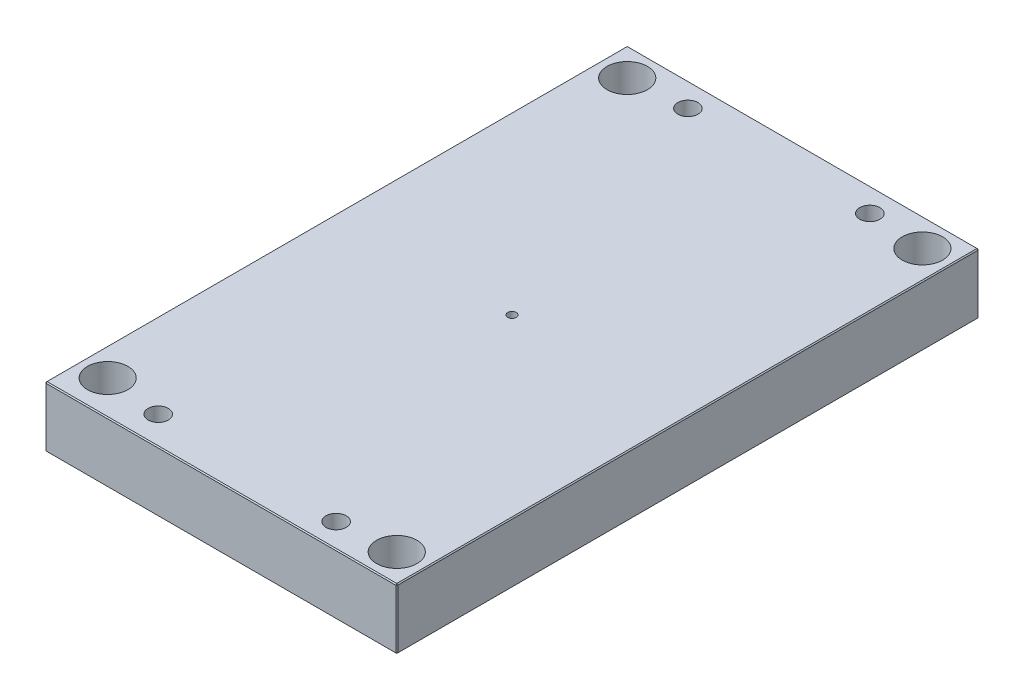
ISO-10303-21;
HEADER;
FILE_DESCRIPTION(('STEP AP214'),'2;1');
FILE_NAME('part.step','',(''),(''),'','','');
FILE_SCHEMA(('AUTOMOTIVE_DESIGN { 1 0 10303 214 1 1 1 1 }'));
ENDSEC;
DATA;
#1=APPLICATION_CONTEXT('core data for automotive mechanical design processes');
#2=APPLICATION_PROTOCOL_DEFINITION('international standard','automotive_design',2000,#1);
#3=PRODUCT_CONTEXT('',#1,'mechanical');
#4=PRODUCT('Part','Part','',(#3));
#5=PRODUCT_RELATED_PRODUCT_CATEGORY('part','',(#4));
#6=PRODUCT_DEFINITION_FORMATION('','',#4);
#7=PRODUCT_DEFINITION_CONTEXT('part definition',#1,'design');
#8=PRODUCT_DEFINITION('design','',#6,#7);
#9=PRODUCT_DEFINITION_SHAPE('','',#8);
#10=(LENGTH_UNIT() NAMED_UNIT(*) SI_UNIT(.MILLI.,.METRE.));
#11=(NAMED_UNIT(*) PLANE_ANGLE_UNIT() SI_UNIT($,.RADIAN.));
#12=(NAMED_UNIT(*) SI_UNIT($,.STERADIAN.) SOLID_ANGLE_UNIT());
#13=UNCERTAINTY_MEASURE_WITH_UNIT(LENGTH_MEASURE(1.E-05),#10,'distance_accuracy_value','');
#14=(GEOMETRIC_REPRESENTATION_CONTEXT(3) GLOBAL_UNCERTAINTY_ASSIGNED_CONTEXT((#13)) GLOBAL_UNIT_ASSIGNED_CONTEXT((#10,
#11,#12)) REPRESENTATION_CONTEXT('',''));
#15=CARTESIAN_POINT('',(0.,0.,0.));
#16=DIRECTION('',(0.,0.,1.));
#17=DIRECTION('',(1.,0.,0.));
#18=AXIS2_PLACEMENT_3D('',#15,#16,#17);
#19=CARTESIAN_POINT('',(138.1125,-47.625,228.6));
#20=DIRECTION('',(0.,-1.,0.));
#21=DIRECTION('',(1.,0.,0.));
#22=AXIS2_PLACEMENT_3D('',#19,#20,#21);
#23=PLANE('',#22);
#24=CARTESIAN_POINT('',(-113.50625,-47.6250000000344,149.225));
#25=DIRECTION('',(0.,-1.,0.));
#26=DIRECTION('',(1.,0.,0.));
#27=AXIS2_PLACEMENT_3D('',#24,#25,#26);
#28=CIRCLE('',#27,9.52499999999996);
#29=CARTESIAN_POINT('',(-103.98125,-47.6250000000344,149.225));
#30=VERTEX_POINT('',#29);
#31=EDGE_CURVE('E351',#30,#30,#28,.T.);
#32=ORIENTED_EDGE('',*,*,#31,.F.);
#33=EDGE_LOOP('',(#32));
#34=FACE_BOUND('',#33,.T.);
#35=CARTESIAN_POINT('',(113.50625,-47.625,-149.225));
#36=DIRECTION('',(0.,-1.,0.));
#37=DIRECTION('',(1.,0.,0.));
#38=AXIS2_PLACEMENT_3D('',#35,#36,#37);
#39=CIRCLE('',#38,9.52499999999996);
#40=CARTESIAN_POINT('',(123.03125,-47.625,-149.225));
#41=VERTEX_POINT('',#40);
#42=EDGE_CURVE('E344',#41,#41,#39,.T.);
#43=ORIENTED_EDGE('',*,*,#42,.F.);
#44=EDGE_LOOP('',(#43));
#45=FACE_BOUND('',#44,.T.);
#46=CARTESIAN_POINT('',(113.50625,-47.625,25.4));
#47=DIRECTION('',(0.,-1.,0.));
#48=DIRECTION('',(0.,0.,-1.));
#49=AXIS2_PLACEMENT_3D('',#46,#47,#48);
#50=CIRCLE('',#49,5.35686);
#51=CARTESIAN_POINT('',(113.50625,-47.625,20.04314));
#52=VERTEX_POINT('',#51);
#53=EDGE_CURVE('E355',#52,#52,#50,.T.);
#54=ORIENTED_EDGE('',*,*,#53,.F.);
#55=EDGE_LOOP('',(#54));
#56=FACE_BOUND('',#55,.T.);
#57=CARTESIAN_POINT('',(-115.8875,-47.6250000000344,-206.375));
#58=DIRECTION('',(0.,-1.,0.));
#59=DIRECTION('',(1.,0.,0.));
#60=AXIS2_PLACEMENT_3D('',#57,#58,#59);
#61=CIRCLE('',#60,18.12925);
#62=CARTESIAN_POINT('',(-97.75825,-47.6250000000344,-206.375));
#63=VERTEX_POINT('',#62);
#64=EDGE_CURVE('E379',#63,#63,#61,.T.);
#65=ORIENTED_EDGE('',*,*,#64,.F.);
#66=EDGE_LOOP('',(#65));
#67=FACE_BOUND('',#66,.T.);
#68=CARTESIAN_POINT('',(115.8875,-47.6250000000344,-206.375));
#69=DIRECTION('',(0.,-1.,0.));
#70=DIRECTION('',(1.,0.,0.));
#71=AXIS2_PLACEMENT_3D('',#68,#69,#70);
#72=CIRCLE('',#71,18.12925);
#73=CARTESIAN_POINT('',(134.01675,-47.6250000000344,-206.375));
#74=VERTEX_POINT('',#73);
#75=EDGE_CURVE('E332',#74,#74,#72,.T.);
#76=ORIENTED_EDGE('',*,*,#75,.F.);
#77=EDGE_LOOP('',(#76));
#78=FACE_BOUND('',#77,.T.);
#79=CARTESIAN_POINT('',(115.8875,-47.6249999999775,206.375));
#80=DIRECTION('',(0.,-1.,0.));
#81=DIRECTION('',(1.,0.,0.));
#82=AXIS2_PLACEMENT_3D('',#79,#80,#81);
#83=CIRCLE('',#82,18.12925);
#84=CARTESIAN_POINT('',(134.01675,-47.6249999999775,206.375));
#85=VERTEX_POINT('',#84);
#86=EDGE_CURVE('E328',#85,#85,#83,.T.);
#87=ORIENTED_EDGE('',*,*,#86,.F.);
#88=EDGE_LOOP('',(#87));
#89=FACE_BOUND('',#88,.T.);
#90=CARTESIAN_POINT('',(-115.8875,-47.625,201.6125));
#91=DIRECTION('',(0.,-1.,0.));
#92=DIRECTION('',(1.,0.,0.));
#93=AXIS2_PLACEMENT_3D('',#90,#91,#92);
#94=CIRCLE('',#93,18.12925);
#95=CARTESIAN_POINT('',(-97.75825,-47.625,201.6125));
#96=VERTEX_POINT('',#95);
#97=EDGE_CURVE('E323',#96,#96,#94,.T.);
#98=ORIENTED_EDGE('',*,*,#97,.F.);
#99=EDGE_LOOP('',(#98));
#100=FACE_BOUND('',#99,.T.);
#101=DIRECTION('',(0.,0.,1.));
#102=VECTOR('',#101,1.);
#103=CARTESIAN_POINT('',(137.31875,-47.625,228.6));
#104=LINE('',#103,#102);
#105=CARTESIAN_POINT('',(137.31875,-47.625,-227.80625));
#106=VERTEX_POINT('',#105);
#107=CARTESIAN_POINT('',(137.31875,-47.625,227.80625));
#108=VERTEX_POINT('',#107);
#109=EDGE_CURVE('E458',#106,#108,#104,.T.);
#110=ORIENTED_EDGE('',*,*,#109,.T.);
#111=DIRECTION('',(-1.,0.,0.));
#112=VECTOR('',#111,1.);
#113=CARTESIAN_POINT('',(138.1125,-47.625,227.80625));
#114=LINE('',#113,#112);
#115=CARTESIAN_POINT('',(-137.31875,-47.625,227.80625));
#116=VERTEX_POINT('',#115);
#117=EDGE_CURVE('E460',#108,#116,#114,.T.);
#118=ORIENTED_EDGE('',*,*,#117,.T.);
#119=DIRECTION('',(0.,0.,-1.));
#120=VECTOR('',#119,1.);
#121=CARTESIAN_POINT('',(-137.31875,-47.625,-228.6));
#122=LINE('',#121,#120);
#123=CARTESIAN_POINT('',(-137.31875,-47.625,-227.80625));
#124=VERTEX_POINT('',#123);
#125=EDGE_CURVE('E456',#116,#124,#122,.T.);
#126=ORIENTED_EDGE('',*,*,#125,.T.);
#127=DIRECTION('',(1.,0.,0.));
#128=VECTOR('',#127,1.);
#129=CARTESIAN_POINT('',(138.1125,-47.625,-227.80625));
#130=LINE('',#129,#128);
#131=EDGE_CURVE('E272',#124,#106,#130,.T.);
#132=ORIENTED_EDGE('',*,*,#131,.T.);
#133=EDGE_LOOP('',(#110,#118,#126,#132));
#134=FACE_BOUND('',#133,.T.);
#135=CARTESIAN_POINT('',(-71.4375,-47.625,-209.55));
#136=DIRECTION('',(0.,1.,0.));
#137=DIRECTION('',(0.,0.,1.));
#138=AXIS2_PLACEMENT_3D('',#135,#136,#137);
#139=CIRCLE('',#138,7.93749999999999);
#140=CARTESIAN_POINT('',(-71.4375,-47.625,-201.6125));
#141=VERTEX_POINT('',#140);
#142=EDGE_CURVE('E396',#141,#141,#139,.T.);
#143=ORIENTED_EDGE('',*,*,#142,.T.);
#144=EDGE_LOOP('',(#143));
#145=FACE_BOUND('',#144,.T.);
#146=CARTESIAN_POINT('',(-71.4375,-47.625,206.375));
#147=DIRECTION('',(0.,1.,0.));
#148=DIRECTION('',(0.,0.,1.));
#149=AXIS2_PLACEMENT_3D('',#146,#147,#148);
#150=CIRCLE('',#149,7.93750000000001);
#151=CARTESIAN_POINT('',(-71.4375,-47.625,214.3125));
#152=VERTEX_POINT('',#151);
#153=EDGE_CURVE('E402',#152,#152,#150,.T.);
#154=ORIENTED_EDGE('',*,*,#153,.T.);
#155=EDGE_LOOP('',(#154));
#156=FACE_BOUND('',#155,.T.);
#157=CARTESIAN_POINT('',(71.4375,-47.625,209.55));
#158=DIRECTION('',(0.,1.,0.));
#159=DIRECTION('',(0.,0.,1.));
#160=AXIS2_PLACEMENT_3D('',#157,#158,#159);
#161=CIRCLE('',#160,7.93749999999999);
#162=CARTESIAN_POINT('',(71.4375,-47.625,217.4875));
#163=VERTEX_POINT('',#162);
#164=EDGE_CURVE('E408',#163,#163,#161,.T.);
#165=ORIENTED_EDGE('',*,*,#164,.T.);
#166=EDGE_LOOP('',(#165));
#167=FACE_BOUND('',#166,.T.);
#168=CARTESIAN_POINT('',(71.4375,-47.625,-209.55));
#169=DIRECTION('',(0.,1.,0.));
#170=DIRECTION('',(0.,0.,1.));
#171=AXIS2_PLACEMENT_3D('',#168,#169,#170);
#172=CIRCLE('',#171,7.93749999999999);
#173=CARTESIAN_POINT('',(71.4375,-47.625,-201.6125));
#174=VERTEX_POINT('',#173);
#175=EDGE_CURVE('E414',#174,#174,#172,.T.);
#176=ORIENTED_EDGE('',*,*,#175,.T.);
#177=EDGE_LOOP('',(#176));
#178=FACE_BOUND('',#177,.T.);
#179=CARTESIAN_POINT('',(0.,-47.625,0.));
#180=DIRECTION('',(0.,1.,0.));
#181=DIRECTION('',(0.,0.,1.));
#182=AXIS2_PLACEMENT_3D('',#179,#180,#181);
#183=CIRCLE('',#182,3.3734375);
#184=CARTESIAN_POINT('',(0.,-47.625,3.3734375));
#185=VERTEX_POINT('',#184);
#186=EDGE_CURVE('E432',#185,#185,#183,.T.);
#187=ORIENTED_EDGE('',*,*,#186,.T.);
#188=EDGE_LOOP('',(#187));
#189=FACE_BOUND('',#188,.T.);
#190=CARTESIAN_POINT('',(113.50625,-47.625,149.225));
#191=DIRECTION('',(0.,-1.,0.));
#192=DIRECTION('',(0.,0.,-1.));
#193=AXIS2_PLACEMENT_3D('',#190,#191,#192);
#194=CIRCLE('',#193,5.35686);
#195=CARTESIAN_POINT('',(113.50625,-47.625,143.86814));
#196=VERTEX_POINT('',#195);
#197=EDGE_CURVE('E370',#196,#196,#194,.T.);
#198=ORIENTED_EDGE('',*,*,#197,.F.);
#199=EDGE_LOOP('',(#198));
#200=FACE_BOUND('',#199,.T.);
#201=CARTESIAN_POINT('',(-113.50625,-47.625,-149.225));
#202=DIRECTION('',(0.,-1.,0.));
#203=DIRECTION('',(0.,0.,-1.));
#204=AXIS2_PLACEMENT_3D('',#201,#202,#203);
#205=CIRCLE('',#204,5.35686);
#206=CARTESIAN_POINT('',(-113.50625,-47.625,-154.58186));
#207=VERTEX_POINT('',#206);
#208=EDGE_CURVE('E361',#207,#207,#205,.T.);
#209=ORIENTED_EDGE('',*,*,#208,.F.);
#210=EDGE_LOOP('',(#209));
#211=FACE_BOUND('',#210,.T.);
#212=CARTESIAN_POINT('',(-113.50625,-47.625,-25.4));
#213=DIRECTION('',(0.,-1.,0.));
#214=DIRECTION('',(0.,0.,-1.));
#215=AXIS2_PLACEMENT_3D('',#212,#213,#214);
#216=CIRCLE('',#215,5.35686);
#217=CARTESIAN_POINT('',(-113.50625,-47.625,-30.75686));
#218=VERTEX_POINT('',#217);
#219=EDGE_CURVE('E336',#218,#218,#216,.T.);
#220=ORIENTED_EDGE('',*,*,#219,.F.);
#221=EDGE_LOOP('',(#220));
#222=FACE_BOUND('',#221,.T.);
#223=ADVANCED_FACE('F34',(#34,#45,#56,#67,#78,#89,#100,#134,#145,#156,#167,#178,#189,#200,#211,
#222),#23,.T.);
#224=CARTESIAN_POINT('',(-115.8875,-47.625,-206.375));
#225=DIRECTION('',(0.,1.,0.));
#226=DIRECTION('',(0.,0.,1.));
#227=AXIS2_PLACEMENT_3D('',#224,#225,#226);
#228=CYLINDRICAL_SURFACE('',#227,15.88135);
#229=CARTESIAN_POINT('',(-115.8875,-5.6843418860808E-11,-206.375));
#230=DIRECTION('',(0.,1.,0.));
#231=DIRECTION('',(0.,0.,1.));
#232=AXIS2_PLACEMENT_3D('',#229,#230,#231);
#233=CIRCLE('',#232,15.88135);
#234=CARTESIAN_POINT('',(-115.8875,-5.6843418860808E-11,-190.49365));
#235=VERTEX_POINT('',#234);
#236=EDGE_CURVE('E417',#235,#235,#233,.T.);
#237=ORIENTED_EDGE('',*,*,#236,.T.);
#238=EDGE_LOOP('',(#237));
#239=FACE_BOUND('',#238,.T.);
#240=CARTESIAN_POINT('',(-115.8875,-42.8625000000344,-206.375));
#241=DIRECTION('',(0.,-1.,0.));
#242=DIRECTION('',(1.,0.,0.));
#243=AXIS2_PLACEMENT_3D('',#240,#241,#242);
#244=CIRCLE('',#243,15.88135);
#245=CARTESIAN_POINT('',(-100.00615,-42.8625000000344,-206.375));
#246=VERTEX_POINT('',#245);
#247=EDGE_CURVE('E330',#246,#246,#244,.F.);
#248=ORIENTED_EDGE('',*,*,#247,.F.);
#249=EDGE_LOOP('',(#248));
#250=FACE_BOUND('',#249,.T.);
#251=ADVANCED_FACE('F156',(#239,#250),#228,.F.);
#252=CARTESIAN_POINT('',(115.8875,-47.625,-206.375));
#253=DIRECTION('',(0.,1.,0.));
#254=DIRECTION('',(0.,0.,1.));
#255=AXIS2_PLACEMENT_3D('',#252,#253,#254);
#256=CYLINDRICAL_SURFACE('',#255,15.88135);
#257=CARTESIAN_POINT('',(115.8875,0.,-206.375));
#258=DIRECTION('',(0.,1.,0.));
#259=DIRECTION('',(0.,0.,1.));
#260=AXIS2_PLACEMENT_3D('',#257,#258,#259);
#261=CIRCLE('',#260,15.88135);
#262=CARTESIAN_POINT('',(115.8875,0.,-190.49365));
#263=VERTEX_POINT('',#262);
#264=EDGE_CURVE('E428',#263,#263,#261,.T.);
#265=ORIENTED_EDGE('',*,*,#264,.T.);
#266=EDGE_LOOP('',(#265));
#267=FACE_BOUND('',#266,.T.);
#268=CARTESIAN_POINT('',(115.8875,-42.8625000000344,-206.375));
#269=DIRECTION('',(0.,-1.,0.));
#270=DIRECTION('',(1.,0.,0.));
#271=AXIS2_PLACEMENT_3D('',#268,#269,#270);
#272=CIRCLE('',#271,15.88135);
#273=CARTESIAN_POINT('',(131.76885,-42.8625000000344,-206.375));
#274=VERTEX_POINT('',#273);
#275=EDGE_CURVE('E325',#274,#274,#272,.F.);
#276=ORIENTED_EDGE('',*,*,#275,.F.);
#277=EDGE_LOOP('',(#276));
#278=FACE_BOUND('',#277,.T.);
#279=ADVANCED_FACE('F162',(#267,#278),#256,.F.);
#280=CARTESIAN_POINT('',(115.8875,-47.625,206.375));
#281=DIRECTION('',(0.,1.,0.));
#282=DIRECTION('',(0.,0.,1.));
#283=AXIS2_PLACEMENT_3D('',#280,#281,#282);
#284=CYLINDRICAL_SURFACE('',#283,15.88135);
#285=CARTESIAN_POINT('',(115.8875,-5.6843418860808E-11,206.375));
#286=DIRECTION('',(0.,1.,0.));
#287=DIRECTION('',(0.,0.,1.));
#288=AXIS2_PLACEMENT_3D('',#285,#286,#287);
#289=CIRCLE('',#288,15.88135);
#290=CARTESIAN_POINT('',(115.8875,-5.6843418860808E-11,222.25635));
#291=VERTEX_POINT('',#290);
#292=EDGE_CURVE('E425',#291,#291,#289,.T.);
#293=ORIENTED_EDGE('',*,*,#292,.T.);
#294=EDGE_LOOP('',(#293));
#295=FACE_BOUND('',#294,.T.);
#296=CARTESIAN_POINT('',(115.8875,-42.8624999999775,206.375));
#297=DIRECTION('',(0.,-1.,0.));
#298=DIRECTION('',(1.,0.,0.));
#299=AXIS2_PLACEMENT_3D('',#296,#297,#298);
#300=CIRCLE('',#299,15.88135);
#301=CARTESIAN_POINT('',(131.76885,-42.8624999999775,206.375));
#302=VERTEX_POINT('',#301);
#303=EDGE_CURVE('E320',#302,#302,#300,.F.);
#304=ORIENTED_EDGE('',*,*,#303,.F.);
#305=EDGE_LOOP('',(#304));
#306=FACE_BOUND('',#305,.T.);
#307=ADVANCED_FACE('F724',(#295,#306),#284,.F.);
#308=CARTESIAN_POINT('',(-115.8875,-47.625,201.6125));
#309=DIRECTION('',(0.,1.,0.));
#310=DIRECTION('',(0.,0.,1.));
#311=AXIS2_PLACEMENT_3D('',#308,#309,#310);
#312=CYLINDRICAL_SURFACE('',#311,15.88135);
#313=CARTESIAN_POINT('',(-115.8875,-1.13686837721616E-10,201.6125));
#314=DIRECTION('',(0.,1.,0.));
#315=DIRECTION('',(0.,0.,1.));
#316=AXIS2_PLACEMENT_3D('',#313,#314,#315);
#317=CIRCLE('',#316,15.88135);
#318=CARTESIAN_POINT('',(-115.8875,-1.13686837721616E-10,217.49385));
#319=VERTEX_POINT('',#318);
#320=EDGE_CURVE('E422',#319,#319,#317,.T.);
#321=ORIENTED_EDGE('',*,*,#320,.T.);
#322=EDGE_LOOP('',(#321));
#323=FACE_BOUND('',#322,.T.);
#324=CARTESIAN_POINT('',(-115.8875,-42.8625,201.6125));
#325=DIRECTION('',(0.,-1.,0.));
#326=DIRECTION('',(1.,0.,0.));
#327=AXIS2_PLACEMENT_3D('',#324,#325,#326);
#328=CIRCLE('',#327,15.88135);
#329=CARTESIAN_POINT('',(-100.00615,-42.8625,201.6125));
#330=VERTEX_POINT('',#329);
#331=EDGE_CURVE('E315',#330,#330,#328,.F.);
#332=ORIENTED_EDGE('',*,*,#331,.F.);
#333=EDGE_LOOP('',(#332));
#334=FACE_BOUND('',#333,.T.);
#335=ADVANCED_FACE('F174',(#323,#334),#312,.F.);
#336=CARTESIAN_POINT('',(-138.1125,0.,228.6));
#337=DIRECTION('',(1.,0.,0.));
#338=DIRECTION('',(0.,0.,-1.));
#339=AXIS2_PLACEMENT_3D('',#336,#337,#338);
#340=PLANE('',#339);
#341=DIRECTION('',(0.,1.,0.));
#342=VECTOR('',#341,1.);
#343=CARTESIAN_POINT('',(-138.1125,0.,227.80625));
#344=LINE('',#343,#342);
#345=CARTESIAN_POINT('',(-138.1125,-46.83125,227.80625));
#346=VERTEX_POINT('',#345);
#347=CARTESIAN_POINT('',(-138.1125,-0.793750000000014,227.80625));
#348=VERTEX_POINT('',#347);
#349=EDGE_CURVE('E475',#346,#348,#344,.T.);
#350=ORIENTED_EDGE('',*,*,#349,.T.);
#351=DIRECTION('',(0.,0.,-1.));
#352=VECTOR('',#351,1.);
#353=CARTESIAN_POINT('',(-138.1125,-0.793750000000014,-228.6));
#354=LINE('',#353,#352);
#355=CARTESIAN_POINT('',(-138.1125,-0.793750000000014,-227.80625));
#356=VERTEX_POINT('',#355);
#357=EDGE_CURVE('E279',#348,#356,#354,.T.);
#358=ORIENTED_EDGE('',*,*,#357,.T.);
#359=DIRECTION('',(0.,-1.,0.));
#360=VECTOR('',#359,1.);
#361=CARTESIAN_POINT('',(-138.1125,0.,-227.80625));
#362=LINE('',#361,#360);
#363=CARTESIAN_POINT('',(-138.1125,-46.83125,-227.80625));
#364=VERTEX_POINT('',#363);
#365=EDGE_CURVE('E293',#356,#364,#362,.T.);
#366=ORIENTED_EDGE('',*,*,#365,.T.);
#367=DIRECTION('',(0.,0.,1.));
#368=VECTOR('',#367,1.);
#369=CARTESIAN_POINT('',(-138.1125,-46.83125,228.6));
#370=LINE('',#369,#368);
#371=EDGE_CURVE('E473',#364,#346,#370,.T.);
#372=ORIENTED_EDGE('',*,*,#371,.T.);
#373=EDGE_LOOP('',(#350,#358,#366,#372));
#374=FACE_BOUND('',#373,.T.);
#375=ADVANCED_FACE('F171',(#374),#340,.F.);
#376=CARTESIAN_POINT('',(138.1125,-47.625,228.6));
#377=DIRECTION('',(-1.,0.,0.));
#378=DIRECTION('',(0.,-1.,0.));
#379=AXIS2_PLACEMENT_3D('',#376,#377,#378);
#380=PLANE('',#379);
#381=DIRECTION('',(0.,-1.,0.));
#382=VECTOR('',#381,1.);
#383=CARTESIAN_POINT('',(138.1125,-47.625,227.80625));
#384=LINE('',#383,#382);
#385=CARTESIAN_POINT('',(138.1125,-0.793750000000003,227.80625));
#386=VERTEX_POINT('',#385);
#387=CARTESIAN_POINT('',(138.1125,-46.83125,227.80625));
#388=VERTEX_POINT('',#387);
#389=EDGE_CURVE('E467',#386,#388,#384,.T.);
#390=ORIENTED_EDGE('',*,*,#389,.T.);
#391=DIRECTION('',(0.,0.,-1.));
#392=VECTOR('',#391,1.);
#393=CARTESIAN_POINT('',(138.1125,-46.83125,-228.6));
#394=LINE('',#393,#392);
#395=CARTESIAN_POINT('',(138.1125,-46.83125,-227.80625));
#396=VERTEX_POINT('',#395);
#397=EDGE_CURVE('E469',#388,#396,#394,.T.);
#398=ORIENTED_EDGE('',*,*,#397,.T.);
#399=DIRECTION('',(0.,1.,0.));
#400=VECTOR('',#399,1.);
#401=CARTESIAN_POINT('',(138.1125,-47.625,-227.80625));
#402=LINE('',#401,#400);
#403=CARTESIAN_POINT('',(138.1125,-0.793750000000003,-227.80625));
#404=VERTEX_POINT('',#403);
#405=EDGE_CURVE('E463',#396,#404,#402,.T.);
#406=ORIENTED_EDGE('',*,*,#405,.T.);
#407=DIRECTION('',(0.,0.,1.));
#408=VECTOR('',#407,1.);
#409=CARTESIAN_POINT('',(138.1125,-0.793750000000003,228.6));
#410=LINE('',#409,#408);
#411=EDGE_CURVE('E465',#404,#386,#410,.T.);
#412=ORIENTED_EDGE('',*,*,#411,.T.);
#413=EDGE_LOOP('',(#390,#398,#406,#412));
#414=FACE_BOUND('',#413,.T.);
#415=ADVANCED_FACE('F169',(#414),#380,.F.);
#416=CARTESIAN_POINT('',(-138.1125,0.,228.6));
#417=DIRECTION('',(0.,1.,0.));
#418=DIRECTION('',(0.,0.,1.));
#419=AXIS2_PLACEMENT_3D('',#416,#417,#418);
#420=PLANE('',#419);
#421=DIRECTION('',(0.,0.,1.));
#422=VECTOR('',#421,1.);
#423=CARTESIAN_POINT('',(-137.31875,0.,228.6));
#424=LINE('',#423,#422);
#425=CARTESIAN_POINT('',(-137.31875,0.,-227.80625));
#426=VERTEX_POINT('',#425);
#427=CARTESIAN_POINT('',(-137.31875,0.,227.80625));
#428=VERTEX_POINT('',#427);
#429=EDGE_CURVE('E439',#426,#428,#424,.T.);
#430=ORIENTED_EDGE('',*,*,#429,.T.);
#431=DIRECTION('',(1.,0.,0.));
#432=VECTOR('',#431,1.);
#433=CARTESIAN_POINT('',(-138.1125,0.,227.80625));
#434=LINE('',#433,#432);
#435=CARTESIAN_POINT('',(137.31875,0.,227.80625));
#436=VERTEX_POINT('',#435);
#437=EDGE_CURVE('E443',#428,#436,#434,.T.);
#438=ORIENTED_EDGE('',*,*,#437,.T.);
#439=DIRECTION('',(0.,0.,-1.));
#440=VECTOR('',#439,1.);
#441=CARTESIAN_POINT('',(137.31875,0.,-228.6));
#442=LINE('',#441,#440);
#443=CARTESIAN_POINT('',(137.31875,0.,-227.80625));
#444=VERTEX_POINT('',#443);
#445=EDGE_CURVE('E441',#436,#444,#442,.T.);
#446=ORIENTED_EDGE('',*,*,#445,.T.);
#447=DIRECTION('',(-1.,0.,0.));
#448=VECTOR('',#447,1.);
#449=CARTESIAN_POINT('',(-138.1125,0.,-227.80625));
#450=LINE('',#449,#448);
#451=EDGE_CURVE('E435',#444,#426,#450,.T.);
#452=ORIENTED_EDGE('',*,*,#451,.T.);
#453=EDGE_LOOP('',(#430,#438,#446,#452));
#454=FACE_BOUND('',#453,.T.);
#455=CARTESIAN_POINT('',(-71.4375,-5.6843418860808E-11,-209.55));
#456=DIRECTION('',(0.,1.,0.));
#457=DIRECTION('',(0.,0.,1.));
#458=AXIS2_PLACEMENT_3D('',#455,#456,#457);
#459=CIRCLE('',#458,7.93749999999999);
#460=CARTESIAN_POINT('',(-71.4375,-5.6843418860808E-11,-201.6125));
#461=VERTEX_POINT('',#460);
#462=EDGE_CURVE('E273',#461,#461,#459,.T.);
#463=ORIENTED_EDGE('',*,*,#462,.F.);
#464=EDGE_LOOP('',(#463));
#465=FACE_BOUND('',#464,.T.);
#466=CARTESIAN_POINT('',(-71.4375,-5.6843418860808E-11,206.375));
#467=DIRECTION('',(0.,1.,0.));
#468=DIRECTION('',(0.,0.,1.));
#469=AXIS2_PLACEMENT_3D('',#466,#467,#468);
#470=CIRCLE('',#469,7.93750000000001);
#471=CARTESIAN_POINT('',(-71.4375,-5.6843418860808E-11,214.3125));
#472=VERTEX_POINT('',#471);
#473=EDGE_CURVE('E399',#472,#472,#470,.T.);
#474=ORIENTED_EDGE('',*,*,#473,.F.);
#475=EDGE_LOOP('',(#474));
#476=FACE_BOUND('',#475,.T.);
#477=CARTESIAN_POINT('',(71.4375,-5.6843418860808E-11,209.55));
#478=DIRECTION('',(0.,1.,0.));
#479=DIRECTION('',(0.,0.,1.));
#480=AXIS2_PLACEMENT_3D('',#477,#478,#479);
#481=CIRCLE('',#480,7.93749999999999);
#482=CARTESIAN_POINT('',(71.4375,-5.6843418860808E-11,217.4875));
#483=VERTEX_POINT('',#482);
#484=EDGE_CURVE('E405',#483,#483,#481,.T.);
#485=ORIENTED_EDGE('',*,*,#484,.F.);
#486=EDGE_LOOP('',(#485));
#487=FACE_BOUND('',#486,.T.);
#488=CARTESIAN_POINT('',(71.4375,0.,-209.55));
#489=DIRECTION('',(0.,1.,0.));
#490=DIRECTION('',(0.,0.,1.));
#491=AXIS2_PLACEMENT_3D('',#488,#489,#490);
#492=CIRCLE('',#491,7.93749999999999);
#493=CARTESIAN_POINT('',(71.4375,0.,-201.6125));
#494=VERTEX_POINT('',#493);
#495=EDGE_CURVE('E411',#494,#494,#492,.T.);
#496=ORIENTED_EDGE('',*,*,#495,.F.);
#497=EDGE_LOOP('',(#496));
#498=FACE_BOUND('',#497,.T.);
#499=ORIENTED_EDGE('',*,*,#236,.F.);
#500=EDGE_LOOP('',(#499));
#501=FACE_BOUND('',#500,.T.);
#502=ORIENTED_EDGE('',*,*,#320,.F.);
#503=EDGE_LOOP('',(#502));
#504=FACE_BOUND('',#503,.T.);
#505=ORIENTED_EDGE('',*,*,#292,.F.);
#506=EDGE_LOOP('',(#505));
#507=FACE_BOUND('',#506,.T.);
#508=ORIENTED_EDGE('',*,*,#264,.F.);
#509=EDGE_LOOP('',(#508));
#510=FACE_BOUND('',#509,.T.);
#511=CARTESIAN_POINT('',(0.,0.,0.));
#512=DIRECTION('',(0.,1.,0.));
#513=DIRECTION('',(0.,0.,1.));
#514=AXIS2_PLACEMENT_3D('',#511,#512,#513);
#515=CIRCLE('',#514,3.3734375);
#516=CARTESIAN_POINT('',(0.,0.,3.3734375));
#517=VERTEX_POINT('',#516);
#518=EDGE_CURVE('E431',#517,#517,#515,.T.);
#519=ORIENTED_EDGE('',*,*,#518,.F.);
#520=EDGE_LOOP('',(#519));
#521=FACE_BOUND('',#520,.T.);
#522=ADVANCED_FACE('F545',(#454,#465,#476,#487,#498,#501,#504,#507,#510,#521),#420,.T.);
#523=CARTESIAN_POINT('',(-138.1125,0.,228.6));
#524=DIRECTION('',(0.,0.,1.));
#525=DIRECTION('',(1.,0.,0.));
#526=AXIS2_PLACEMENT_3D('',#523,#524,#525);
#527=PLANE('',#526);
#528=DIRECTION('',(1.,0.,0.));
#529=VECTOR('',#528,1.);
#530=CARTESIAN_POINT('',(-138.1125,-46.83125,228.6));
#531=LINE('',#530,#529);
#532=CARTESIAN_POINT('',(-137.31875,-46.83125,228.6));
#533=VERTEX_POINT('',#532);
#534=CARTESIAN_POINT('',(137.31875,-46.83125,228.6));
#535=VERTEX_POINT('',#534);
#536=EDGE_CURVE('E448',#533,#535,#531,.T.);
#537=ORIENTED_EDGE('',*,*,#536,.T.);
#538=DIRECTION('',(0.,1.,0.));
#539=VECTOR('',#538,1.);
#540=CARTESIAN_POINT('',(137.31875,0.,228.6));
#541=LINE('',#540,#539);
#542=CARTESIAN_POINT('',(137.31875,-0.793750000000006,228.6));
#543=VERTEX_POINT('',#542);
#544=EDGE_CURVE('E453',#535,#543,#541,.T.);
#545=ORIENTED_EDGE('',*,*,#544,.T.);
#546=DIRECTION('',(-1.,0.,0.));
#547=VECTOR('',#546,1.);
#548=CARTESIAN_POINT('',(-138.1125,-0.793750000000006,228.6));
#549=LINE('',#548,#547);
#550=CARTESIAN_POINT('',(-137.31875,-0.793750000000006,228.6));
#551=VERTEX_POINT('',#550);
#552=EDGE_CURVE('E450',#543,#551,#549,.T.);
#553=ORIENTED_EDGE('',*,*,#552,.T.);
#554=DIRECTION('',(0.,-1.,0.));
#555=VECTOR('',#554,1.);
#556=CARTESIAN_POINT('',(-137.31875,-47.625,228.6));
#557=LINE('',#556,#555);
#558=EDGE_CURVE('E446',#551,#533,#557,.T.);
#559=ORIENTED_EDGE('',*,*,#558,.T.);
#560=EDGE_LOOP('',(#537,#545,#553,#559));
#561=FACE_BOUND('',#560,.T.);
#562=ADVANCED_FACE('F529',(#561),#527,.T.);
#563=CARTESIAN_POINT('',(-138.1125,0.,-228.6));
#564=DIRECTION('',(0.,0.,1.));
#565=DIRECTION('',(1.,0.,0.));
#566=AXIS2_PLACEMENT_3D('',#563,#564,#565);
#567=PLANE('',#566);
#568=DIRECTION('',(0.,-1.,0.));
#569=VECTOR('',#568,1.);
#570=CARTESIAN_POINT('',(137.31875,-1.60519745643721E-13,-228.6));
#571=LINE('',#570,#569);
#572=CARTESIAN_POINT('',(137.31875,-0.793750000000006,-228.6));
#573=VERTEX_POINT('',#572);
#574=CARTESIAN_POINT('',(137.31875,-46.83125,-228.6));
#575=VERTEX_POINT('',#574);
#576=EDGE_CURVE('E43',#573,#575,#571,.T.);
#577=ORIENTED_EDGE('',*,*,#576,.T.);
#578=DIRECTION('',(-1.,0.,0.));
#579=VECTOR('',#578,1.);
#580=CARTESIAN_POINT('',(-138.1125,-46.83125,-228.6));
#581=LINE('',#580,#579);
#582=CARTESIAN_POINT('',(-137.31875,-46.83125,-228.6));
#583=VERTEX_POINT('',#582);
#584=EDGE_CURVE('E11',#575,#583,#581,.T.);
#585=ORIENTED_EDGE('',*,*,#584,.T.);
#586=DIRECTION('',(0.,1.,0.));
#587=VECTOR('',#586,1.);
#588=CARTESIAN_POINT('',(-137.31875,0.,-228.6));
#589=LINE('',#588,#587);
#590=CARTESIAN_POINT('',(-137.31875,-0.793750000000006,-228.6));
#591=VERTEX_POINT('',#590);
#592=EDGE_CURVE('E277',#583,#591,#589,.T.);
#593=ORIENTED_EDGE('',*,*,#592,.T.);
#594=DIRECTION('',(1.,0.,0.));
#595=VECTOR('',#594,1.);
#596=CARTESIAN_POINT('',(138.1125,-0.793750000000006,-228.6));
#597=LINE('',#596,#595);
#598=EDGE_CURVE('E54',#591,#573,#597,.T.);
#599=ORIENTED_EDGE('',*,*,#598,.T.);
#600=EDGE_LOOP('',(#577,#585,#593,#599));
#601=FACE_BOUND('',#600,.T.);
#602=ADVANCED_FACE('F276',(#601),#567,.F.);
#603=CARTESIAN_POINT('',(0.,-47.625,0.));
#604=DIRECTION('',(0.,1.,0.));
#605=DIRECTION('',(0.,0.,1.));
#606=AXIS2_PLACEMENT_3D('',#603,#604,#605);
#607=CYLINDRICAL_SURFACE('',#606,3.3734375);
#608=ORIENTED_EDGE('',*,*,#186,.F.);
#609=EDGE_LOOP('',(#608));
#610=FACE_BOUND('',#609,.T.);
#611=ORIENTED_EDGE('',*,*,#518,.T.);
#612=EDGE_LOOP('',(#611));
#613=FACE_BOUND('',#612,.T.);
#614=ADVANCED_FACE('F566',(#610,#613),#607,.F.);
#615=CARTESIAN_POINT('',(71.4375,-47.625,-209.55));
#616=DIRECTION('',(0.,1.,0.));
#617=DIRECTION('',(0.,0.,1.));
#618=AXIS2_PLACEMENT_3D('',#615,#616,#617);
#619=CYLINDRICAL_SURFACE('',#618,7.93749999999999);
#620=ORIENTED_EDGE('',*,*,#175,.F.);
#621=EDGE_LOOP('',(#620));
#622=FACE_BOUND('',#621,.T.);
#623=ORIENTED_EDGE('',*,*,#495,.T.);
#624=EDGE_LOOP('',(#623));
#625=FACE_BOUND('',#624,.T.);
#626=ADVANCED_FACE('F568',(#622,#625),#619,.F.);
#627=CARTESIAN_POINT('',(71.4375,-47.625,209.55));
#628=DIRECTION('',(0.,1.,0.));
#629=DIRECTION('',(0.,0.,1.));
#630=AXIS2_PLACEMENT_3D('',#627,#628,#629);
#631=CYLINDRICAL_SURFACE('',#630,7.93749999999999);
#632=ORIENTED_EDGE('',*,*,#164,.F.);
#633=EDGE_LOOP('',(#632));
#634=FACE_BOUND('',#633,.T.);
#635=ORIENTED_EDGE('',*,*,#484,.T.);
#636=EDGE_LOOP('',(#635));
#637=FACE_BOUND('',#636,.T.);
#638=ADVANCED_FACE('F575',(#634,#637),#631,.F.);
#639=CARTESIAN_POINT('',(-71.4375,-47.625,206.375));
#640=DIRECTION('',(0.,1.,0.));
#641=DIRECTION('',(0.,0.,1.));
#642=AXIS2_PLACEMENT_3D('',#639,#640,#641);
#643=CYLINDRICAL_SURFACE('',#642,7.93750000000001);
#644=ORIENTED_EDGE('',*,*,#153,.F.);
#645=EDGE_LOOP('',(#644));
#646=FACE_BOUND('',#645,.T.);
#647=ORIENTED_EDGE('',*,*,#473,.T.);
#648=EDGE_LOOP('',(#647));
#649=FACE_BOUND('',#648,.T.);
#650=ADVANCED_FACE('F988',(#646,#649),#643,.F.);
#651=CARTESIAN_POINT('',(-71.4375,-47.625,-209.55));
#652=DIRECTION('',(0.,1.,0.));
#653=DIRECTION('',(0.,0.,1.));
#654=AXIS2_PLACEMENT_3D('',#651,#652,#653);
#655=CYLINDRICAL_SURFACE('',#654,7.93749999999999);
#656=ORIENTED_EDGE('',*,*,#142,.F.);
#657=EDGE_LOOP('',(#656));
#658=FACE_BOUND('',#657,.T.);
#659=ORIENTED_EDGE('',*,*,#462,.T.);
#660=EDGE_LOOP('',(#659));
#661=FACE_BOUND('',#660,.T.);
#662=ADVANCED_FACE('F254',(#658,#661),#655,.F.);
#663=CARTESIAN_POINT('',(-138.1125,-46.83125,-228.6));
#664=DIRECTION('',(0.,-0.707106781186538,-0.707106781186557));
#665=DIRECTION('',(0.,0.707106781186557,-0.707106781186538));
#666=AXIS2_PLACEMENT_3D('',#663,#664,#665);
#667=PLANE('',#666);
#668=DIRECTION('',(0.,-0.707106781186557,0.707106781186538));
#669=VECTOR('',#668,1.);
#670=CARTESIAN_POINT('',(-137.31875,-47.625,-227.80625));
#671=LINE('',#670,#669);
#672=EDGE_CURVE('E262',#583,#124,#671,.T.);
#673=ORIENTED_EDGE('',*,*,#672,.F.);
#674=ORIENTED_EDGE('',*,*,#584,.F.);
#675=DIRECTION('',(0.,0.707106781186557,-0.707106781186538));
#676=VECTOR('',#675,1.);
#677=CARTESIAN_POINT('',(137.31875,-47.228125,-228.203125));
#678=LINE('',#677,#676);
#679=EDGE_CURVE('E274',#106,#575,#678,.T.);
#680=ORIENTED_EDGE('',*,*,#679,.F.);
#681=ORIENTED_EDGE('',*,*,#131,.F.);
#682=EDGE_LOOP('',(#673,#674,#680,#681));
#683=FACE_BOUND('',#682,.T.);
#684=ADVANCED_FACE('F36',(#683),#667,.T.);
#685=CARTESIAN_POINT('',(-137.31875,-47.625,-227.80625));
#686=DIRECTION('',(-0.577350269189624,-0.577350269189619,-0.577350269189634));
#687=DIRECTION('',(-0.707106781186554,0.,0.707106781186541));
#688=AXIS2_PLACEMENT_3D('',#685,#686,#687);
#689=PLANE('',#688);
#690=DIRECTION('',(-0.70710678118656,0.,0.707106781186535));
#691=VECTOR('',#690,1.);
#692=CARTESIAN_POINT('',(-137.715625,-46.83125,-228.203125));
#693=LINE('',#692,#691);
#694=EDGE_CURVE('E260',#583,#364,#693,.T.);
#695=ORIENTED_EDGE('',*,*,#694,.F.);
#696=ORIENTED_EDGE('',*,*,#672,.T.);
#697=DIRECTION('',(-0.707106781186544,0.707106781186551,0.));
#698=VECTOR('',#697,1.);
#699=CARTESIAN_POINT('',(-137.31875,-47.625,-227.80625));
#700=LINE('',#699,#698);
#701=EDGE_CURVE('E264',#364,#124,#700,.F.);
#702=ORIENTED_EDGE('',*,*,#701,.F.);
#703=EDGE_LOOP('',(#695,#696,#702));
#704=FACE_BOUND('',#703,.T.);
#705=ADVANCED_FACE('F247',(#704),#689,.T.);
#706=CARTESIAN_POINT('',(138.1125,-46.83125,-227.80625));
#707=DIRECTION('',(0.577350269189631,-0.577350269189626,-0.577350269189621));
#708=DIRECTION('',(0.707106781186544,0.70710678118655,0.));
#709=AXIS2_PLACEMENT_3D('',#706,#707,#708);
#710=PLANE('',#709);
#711=DIRECTION('',(-0.707106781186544,-0.707106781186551,0.));
#712=VECTOR('',#711,1.);
#713=CARTESIAN_POINT('',(138.1125,-46.83125,-227.80625));
#714=LINE('',#713,#712);
#715=EDGE_CURVE('E308',#106,#396,#714,.F.);
#716=ORIENTED_EDGE('',*,*,#715,.F.);
#717=ORIENTED_EDGE('',*,*,#679,.T.);
#718=DIRECTION('',(-0.707106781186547,0.,-0.707106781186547));
#719=VECTOR('',#718,1.);
#720=CARTESIAN_POINT('',(138.1125,-46.83125,-227.80625));
#721=LINE('',#720,#719);
#722=EDGE_CURVE('E267',#396,#575,#721,.T.);
#723=ORIENTED_EDGE('',*,*,#722,.F.);
#724=EDGE_LOOP('',(#716,#717,#723));
#725=FACE_BOUND('',#724,.T.);
#726=ADVANCED_FACE('F244',(#725),#710,.T.);
#727=CARTESIAN_POINT('',(-137.31875,-47.625,228.6));
#728=DIRECTION('',(-0.707106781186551,-0.707106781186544,0.));
#729=DIRECTION('',(0.707106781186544,-0.707106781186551,0.));
#730=AXIS2_PLACEMENT_3D('',#727,#728,#729);
#731=PLANE('',#730);
#732=ORIENTED_EDGE('',*,*,#701,.T.);
#733=ORIENTED_EDGE('',*,*,#125,.F.);
#734=DIRECTION('',(0.707106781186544,-0.707106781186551,0.));
#735=VECTOR('',#734,1.);
#736=CARTESIAN_POINT('',(-137.31875,-47.625,227.80625));
#737=LINE('',#736,#735);
#738=EDGE_CURVE('E295',#346,#116,#737,.T.);
#739=ORIENTED_EDGE('',*,*,#738,.F.);
#740=ORIENTED_EDGE('',*,*,#371,.F.);
#741=EDGE_LOOP('',(#732,#733,#739,#740));
#742=FACE_BOUND('',#741,.T.);
#743=ADVANCED_FACE('F240',(#742),#731,.T.);
#744=CARTESIAN_POINT('',(-138.1125,0.,-227.80625));
#745=DIRECTION('',(0.707106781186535,0.,0.70710678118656));
#746=DIRECTION('',(0.70710678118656,0.,-0.707106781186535));
#747=AXIS2_PLACEMENT_3D('',#744,#745,#746);
#748=PLANE('',#747);
#749=ORIENTED_EDGE('',*,*,#694,.T.);
#750=ORIENTED_EDGE('',*,*,#365,.F.);
#751=DIRECTION('',(0.70710678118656,0.,-0.707106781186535));
#752=VECTOR('',#751,1.);
#753=CARTESIAN_POINT('',(-138.1125,-0.793750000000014,-227.80625));
#754=LINE('',#753,#752);
#755=EDGE_CURVE('E292',#591,#356,#754,.F.);
#756=ORIENTED_EDGE('',*,*,#755,.F.);
#757=ORIENTED_EDGE('',*,*,#592,.F.);
#758=EDGE_LOOP('',(#749,#750,#756,#757));
#759=FACE_BOUND('',#758,.T.);
#760=ADVANCED_FACE('F236',(#759),#748,.F.);
#761=CARTESIAN_POINT('',(-138.1125,-0.793750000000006,-228.6));
#762=DIRECTION('',(0.,0.707106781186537,-0.707106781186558));
#763=DIRECTION('',(0.,0.707106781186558,0.707106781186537));
#764=AXIS2_PLACEMENT_3D('',#761,#762,#763);
#765=PLANE('',#764);
#766=DIRECTION('',(0.,0.707106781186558,0.707106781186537));
#767=VECTOR('',#766,1.);
#768=CARTESIAN_POINT('',(137.31875,0.,-227.80625));
#769=LINE('',#768,#767);
#770=EDGE_CURVE('E288',#573,#444,#769,.T.);
#771=ORIENTED_EDGE('',*,*,#770,.F.);
#772=ORIENTED_EDGE('',*,*,#598,.F.);
#773=DIRECTION('',(0.,-0.707106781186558,-0.707106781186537));
#774=VECTOR('',#773,1.);
#775=CARTESIAN_POINT('',(-137.31875,-0.396875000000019,-228.203125));
#776=LINE('',#775,#774);
#777=EDGE_CURVE('E285',#426,#591,#776,.T.);
#778=ORIENTED_EDGE('',*,*,#777,.F.);
#779=ORIENTED_EDGE('',*,*,#451,.F.);
#780=EDGE_LOOP('',(#771,#772,#778,#779));
#781=FACE_BOUND('',#780,.T.);
#782=ADVANCED_FACE('F232',(#781),#765,.T.);
#783=CARTESIAN_POINT('',(138.1125,-47.625,-227.80625));
#784=DIRECTION('',(-0.707106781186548,0.,0.707106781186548));
#785=DIRECTION('',(0.707106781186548,0.,0.707106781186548));
#786=AXIS2_PLACEMENT_3D('',#783,#784,#785);
#787=PLANE('',#786);
#788=ORIENTED_EDGE('',*,*,#722,.T.);
#789=ORIENTED_EDGE('',*,*,#576,.F.);
#790=DIRECTION('',(0.707106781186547,0.,0.707106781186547));
#791=VECTOR('',#790,1.);
#792=CARTESIAN_POINT('',(137.715625,-0.793750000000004,-228.203125));
#793=LINE('',#792,#791);
#794=EDGE_CURVE('E300',#404,#573,#793,.F.);
#795=ORIENTED_EDGE('',*,*,#794,.F.);
#796=ORIENTED_EDGE('',*,*,#405,.F.);
#797=EDGE_LOOP('',(#788,#789,#795,#796));
#798=FACE_BOUND('',#797,.T.);
#799=ADVANCED_FACE('F228',(#798),#787,.F.);
#800=CARTESIAN_POINT('',(138.1125,-46.83125,228.6));
#801=DIRECTION('',(0.707106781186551,-0.707106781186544,0.));
#802=DIRECTION('',(0.707106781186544,0.707106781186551,0.));
#803=AXIS2_PLACEMENT_3D('',#800,#801,#802);
#804=PLANE('',#803);
#805=ORIENTED_EDGE('',*,*,#715,.T.);
#806=ORIENTED_EDGE('',*,*,#397,.F.);
#807=DIRECTION('',(0.707106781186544,0.707106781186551,0.));
#808=VECTOR('',#807,1.);
#809=CARTESIAN_POINT('',(137.715625,-47.228125,227.80625));
#810=LINE('',#809,#808);
#811=EDGE_CURVE('E507',#108,#388,#810,.T.);
#812=ORIENTED_EDGE('',*,*,#811,.F.);
#813=ORIENTED_EDGE('',*,*,#109,.F.);
#814=EDGE_LOOP('',(#805,#806,#812,#813));
#815=FACE_BOUND('',#814,.T.);
#816=ADVANCED_FACE('F224',(#815),#804,.T.);
#817=CARTESIAN_POINT('',(138.1125,-47.625,227.80625));
#818=DIRECTION('',(0.,0.707106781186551,-0.707106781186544));
#819=DIRECTION('',(0.,0.707106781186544,0.707106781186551));
#820=AXIS2_PLACEMENT_3D('',#817,#818,#819);
#821=PLANE('',#820);
#822=DIRECTION('',(0.,-0.707106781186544,-0.707106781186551));
#823=VECTOR('',#822,1.);
#824=CARTESIAN_POINT('',(-137.31875,-47.625,227.80625));
#825=LINE('',#824,#823);
#826=EDGE_CURVE('E305',#116,#533,#825,.F.);
#827=ORIENTED_EDGE('',*,*,#826,.F.);
#828=ORIENTED_EDGE('',*,*,#117,.F.);
#829=DIRECTION('',(0.,0.707106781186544,0.707106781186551));
#830=VECTOR('',#829,1.);
#831=CARTESIAN_POINT('',(137.31875,-46.83125,228.6));
#832=LINE('',#831,#830);
#833=EDGE_CURVE('E504',#535,#108,#832,.F.);
#834=ORIENTED_EDGE('',*,*,#833,.F.);
#835=ORIENTED_EDGE('',*,*,#536,.F.);
#836=EDGE_LOOP('',(#827,#828,#834,#835));
#837=FACE_BOUND('',#836,.T.);
#838=ADVANCED_FACE('F220',(#837),#821,.F.);
#839=CARTESIAN_POINT('',(-137.31875,-47.625,227.80625));
#840=DIRECTION('',(-0.577350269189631,-0.577350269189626,0.577350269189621));
#841=DIRECTION('',(0.707106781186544,-0.707106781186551,0.));
#842=AXIS2_PLACEMENT_3D('',#839,#840,#841);
#843=PLANE('',#842);
#844=ORIENTED_EDGE('',*,*,#738,.T.);
#845=ORIENTED_EDGE('',*,*,#826,.T.);
#846=DIRECTION('',(-0.707106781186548,0.,-0.707106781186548));
#847=VECTOR('',#846,1.);
#848=CARTESIAN_POINT('',(-137.715625,-46.83125,228.203125));
#849=LINE('',#848,#847);
#850=EDGE_CURVE('E501',#346,#533,#849,.F.);
#851=ORIENTED_EDGE('',*,*,#850,.F.);
#852=EDGE_LOOP('',(#844,#845,#851));
#853=FACE_BOUND('',#852,.T.);
#854=ADVANCED_FACE('F216',(#853),#843,.T.);
#855=CARTESIAN_POINT('',(-138.1125,-0.793750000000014,-227.80625));
#856=DIRECTION('',(-0.577350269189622,0.577350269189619,-0.577350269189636));
#857=DIRECTION('',(-0.707106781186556,0.,0.707106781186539));
#858=AXIS2_PLACEMENT_3D('',#855,#856,#857);
#859=PLANE('',#858);
#860=ORIENTED_EDGE('',*,*,#777,.T.);
#861=ORIENTED_EDGE('',*,*,#755,.T.);
#862=DIRECTION('',(0.707106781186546,0.707106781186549,0.));
#863=VECTOR('',#862,1.);
#864=CARTESIAN_POINT('',(-138.1125,-0.793750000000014,-227.80625));
#865=LINE('',#864,#863);
#866=EDGE_CURVE('E297',#426,#356,#865,.F.);
#867=ORIENTED_EDGE('',*,*,#866,.F.);
#868=EDGE_LOOP('',(#860,#861,#867));
#869=FACE_BOUND('',#868,.T.);
#870=ADVANCED_FACE('F212',(#869),#859,.T.);
#871=CARTESIAN_POINT('',(137.31875,0.,-227.80625));
#872=DIRECTION('',(0.57735026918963,0.577350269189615,-0.577350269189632));
#873=DIRECTION('',(-0.707106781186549,0.,-0.707106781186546));
#874=AXIS2_PLACEMENT_3D('',#871,#872,#873);
#875=PLANE('',#874);
#876=ORIENTED_EDGE('',*,*,#794,.T.);
#877=ORIENTED_EDGE('',*,*,#770,.T.);
#878=DIRECTION('',(0.707106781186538,-0.707106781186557,0.));
#879=VECTOR('',#878,1.);
#880=CARTESIAN_POINT('',(137.31875,0.,-227.80625));
#881=LINE('',#880,#879);
#882=EDGE_CURVE('E497',#404,#444,#881,.F.);
#883=ORIENTED_EDGE('',*,*,#882,.F.);
#884=EDGE_LOOP('',(#876,#877,#883));
#885=FACE_BOUND('',#884,.T.);
#886=ADVANCED_FACE('F208',(#885),#875,.T.);
#887=CARTESIAN_POINT('',(137.31875,-46.83125,228.6));
#888=DIRECTION('',(0.577350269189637,-0.577350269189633,0.577350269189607));
#889=DIRECTION('',(0.707106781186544,0.707106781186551,0.));
#890=AXIS2_PLACEMENT_3D('',#887,#888,#889);
#891=PLANE('',#890);
#892=ORIENTED_EDGE('',*,*,#833,.T.);
#893=ORIENTED_EDGE('',*,*,#811,.T.);
#894=DIRECTION('',(-0.707106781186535,0.,0.70710678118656));
#895=VECTOR('',#894,1.);
#896=CARTESIAN_POINT('',(137.31875,-46.83125,228.6));
#897=LINE('',#896,#895);
#898=EDGE_CURVE('E494',#535,#388,#897,.F.);
#899=ORIENTED_EDGE('',*,*,#898,.F.);
#900=EDGE_LOOP('',(#892,#893,#899));
#901=FACE_BOUND('',#900,.T.);
#902=ADVANCED_FACE('F204',(#901),#891,.T.);
#903=CARTESIAN_POINT('',(-137.31875,0.,228.6));
#904=DIRECTION('',(-0.707106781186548,0.,0.707106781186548));
#905=DIRECTION('',(0.707106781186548,0.,0.707106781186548));
#906=AXIS2_PLACEMENT_3D('',#903,#904,#905);
#907=PLANE('',#906);
#908=ORIENTED_EDGE('',*,*,#850,.T.);
#909=ORIENTED_EDGE('',*,*,#558,.F.);
#910=DIRECTION('',(0.707106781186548,0.,0.707106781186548));
#911=VECTOR('',#910,1.);
#912=CARTESIAN_POINT('',(-137.31875,-0.793750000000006,228.6));
#913=LINE('',#912,#911);
#914=EDGE_CURVE('E491',#348,#551,#913,.T.);
#915=ORIENTED_EDGE('',*,*,#914,.F.);
#916=ORIENTED_EDGE('',*,*,#349,.F.);
#917=EDGE_LOOP('',(#908,#909,#915,#916));
#918=FACE_BOUND('',#917,.T.);
#919=ADVANCED_FACE('F200',(#918),#907,.T.);
#920=CARTESIAN_POINT('',(-138.1125,-0.793750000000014,228.6));
#921=DIRECTION('',(-0.707106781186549,0.707106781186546,0.));
#922=DIRECTION('',(-0.707106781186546,-0.707106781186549,0.));
#923=AXIS2_PLACEMENT_3D('',#920,#921,#922);
#924=PLANE('',#923);
#925=ORIENTED_EDGE('',*,*,#866,.T.);
#926=ORIENTED_EDGE('',*,*,#357,.F.);
#927=DIRECTION('',(-0.707106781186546,-0.707106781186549,0.));
#928=VECTOR('',#927,1.);
#929=CARTESIAN_POINT('',(-137.715625,-0.396875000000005,227.80625));
#930=LINE('',#929,#928);
#931=EDGE_CURVE('E488',#428,#348,#930,.T.);
#932=ORIENTED_EDGE('',*,*,#931,.F.);
#933=ORIENTED_EDGE('',*,*,#429,.F.);
#934=EDGE_LOOP('',(#925,#926,#932,#933));
#935=FACE_BOUND('',#934,.T.);
#936=ADVANCED_FACE('F196',(#935),#924,.T.);
#937=CARTESIAN_POINT('',(137.31875,0.,228.6));
#938=DIRECTION('',(0.707106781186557,0.707106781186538,0.));
#939=DIRECTION('',(-0.707106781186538,0.707106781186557,0.));
#940=AXIS2_PLACEMENT_3D('',#937,#938,#939);
#941=PLANE('',#940);
#942=ORIENTED_EDGE('',*,*,#882,.T.);
#943=ORIENTED_EDGE('',*,*,#445,.F.);
#944=DIRECTION('',(-0.707106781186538,0.707106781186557,0.));
#945=VECTOR('',#944,1.);
#946=CARTESIAN_POINT('',(137.31875,0.,227.80625));
#947=LINE('',#946,#945);
#948=EDGE_CURVE('E485',#386,#436,#947,.T.);
#949=ORIENTED_EDGE('',*,*,#948,.F.);
#950=ORIENTED_EDGE('',*,*,#411,.F.);
#951=EDGE_LOOP('',(#942,#943,#949,#950));
#952=FACE_BOUND('',#951,.T.);
#953=ADVANCED_FACE('F192',(#952),#941,.T.);
#954=CARTESIAN_POINT('',(137.31875,-1.60519745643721E-13,228.6));
#955=DIRECTION('',(0.70710678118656,0.,0.707106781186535));
#956=DIRECTION('',(0.707106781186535,0.,-0.70710678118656));
#957=AXIS2_PLACEMENT_3D('',#954,#955,#956);
#958=PLANE('',#957);
#959=ORIENTED_EDGE('',*,*,#898,.T.);
#960=ORIENTED_EDGE('',*,*,#389,.F.);
#961=DIRECTION('',(0.707106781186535,0.,-0.70710678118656));
#962=VECTOR('',#961,1.);
#963=CARTESIAN_POINT('',(137.715625,-0.793750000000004,228.203125));
#964=LINE('',#963,#962);
#965=EDGE_CURVE('E482',#543,#386,#964,.T.);
#966=ORIENTED_EDGE('',*,*,#965,.F.);
#967=ORIENTED_EDGE('',*,*,#544,.F.);
#968=EDGE_LOOP('',(#959,#960,#966,#967));
#969=FACE_BOUND('',#968,.T.);
#970=ADVANCED_FACE('F188',(#969),#958,.T.);
#971=CARTESIAN_POINT('',(-137.31875,-0.793750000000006,228.6));
#972=DIRECTION('',(-0.577350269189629,0.577350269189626,0.577350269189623));
#973=DIRECTION('',(-0.707106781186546,-0.707106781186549,0.));
#974=AXIS2_PLACEMENT_3D('',#971,#972,#973);
#975=PLANE('',#974);
#976=ORIENTED_EDGE('',*,*,#931,.T.);
#977=ORIENTED_EDGE('',*,*,#914,.T.);
#978=DIRECTION('',(0.,-0.707106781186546,0.707106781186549));
#979=VECTOR('',#978,1.);
#980=CARTESIAN_POINT('',(-137.31875,-0.793750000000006,228.6));
#981=LINE('',#980,#979);
#982=EDGE_CURVE('E480',#428,#551,#981,.T.);
#983=ORIENTED_EDGE('',*,*,#982,.F.);
#984=EDGE_LOOP('',(#976,#977,#983));
#985=FACE_BOUND('',#984,.T.);
#986=ADVANCED_FACE('F184',(#985),#975,.T.);
#987=CARTESIAN_POINT('',(137.31875,0.,227.80625));
#988=DIRECTION('',(0.577350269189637,0.577350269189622,0.577350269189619));
#989=DIRECTION('',(-0.707106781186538,0.707106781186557,0.));
#990=AXIS2_PLACEMENT_3D('',#987,#988,#989);
#991=PLANE('',#990);
#992=ORIENTED_EDGE('',*,*,#965,.T.);
#993=ORIENTED_EDGE('',*,*,#948,.T.);
#994=DIRECTION('',(0.,0.707106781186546,-0.707106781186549));
#995=VECTOR('',#994,1.);
#996=CARTESIAN_POINT('',(137.31875,0.,227.80625));
#997=LINE('',#996,#995);
#998=EDGE_CURVE('E318',#543,#436,#997,.T.);
#999=ORIENTED_EDGE('',*,*,#998,.F.);
#1000=EDGE_LOOP('',(#992,#993,#999));
#1001=FACE_BOUND('',#1000,.T.);
#1002=ADVANCED_FACE('F180',(#1001),#991,.T.);
#1003=CARTESIAN_POINT('',(-138.1125,0.,227.80625));
#1004=DIRECTION('',(0.,-0.707106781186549,-0.707106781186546));
#1005=DIRECTION('',(0.,0.707106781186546,-0.707106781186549));
#1006=AXIS2_PLACEMENT_3D('',#1003,#1004,#1005);
#1007=PLANE('',#1006);
#1008=ORIENTED_EDGE('',*,*,#982,.T.);
#1009=ORIENTED_EDGE('',*,*,#552,.F.);
#1010=ORIENTED_EDGE('',*,*,#998,.T.);
#1011=ORIENTED_EDGE('',*,*,#437,.F.);
#1012=EDGE_LOOP('',(#1008,#1009,#1010,#1011));
#1013=FACE_BOUND('',#1012,.T.);
#1014=ADVANCED_FACE('F176',(#1013),#1007,.F.);
#1015=CARTESIAN_POINT('',(-115.8875,-42.8625,201.6125));
#1016=DIRECTION('',(0.,-1.,0.));
#1017=DIRECTION('',(1.,0.,0.));
#1018=AXIS2_PLACEMENT_3D('',#1015,#1016,#1017);
#1019=PLANE('',#1018);
#1020=CARTESIAN_POINT('',(-115.8875,-42.8625,201.6125));
#1021=DIRECTION('',(0.,-1.,0.));
#1022=DIRECTION('',(1.,0.,0.));
#1023=AXIS2_PLACEMENT_3D('',#1020,#1021,#1022);
#1024=CIRCLE('',#1023,18.12925);
#1025=CARTESIAN_POINT('',(-97.75825,-42.8625,201.6125));
#1026=VERTEX_POINT('',#1025);
#1027=EDGE_CURVE('E319',#1026,#1026,#1024,.T.);
#1028=ORIENTED_EDGE('',*,*,#1027,.T.);
#1029=EDGE_LOOP('',(#1028));
#1030=FACE_BOUND('',#1029,.T.);
#1031=ORIENTED_EDGE('',*,*,#331,.T.);
#1032=EDGE_LOOP('',(#1031));
#1033=FACE_BOUND('',#1032,.T.);
#1034=ADVANCED_FACE('F179',(#1030,#1033),#1019,.T.);
#1035=CARTESIAN_POINT('',(-115.8875,-42.8625,201.6125));
#1036=DIRECTION('',(0.,-1.,0.));
#1037=DIRECTION('',(1.,0.,0.));
#1038=AXIS2_PLACEMENT_3D('',#1035,#1036,#1037);
#1039=CYLINDRICAL_SURFACE('',#1038,18.12925);
#1040=CARTESIAN_POINT('',(-97.75825,-42.8625,201.6125));
#1041=CARTESIAN_POINT('',(-97.75825,-42.912109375,201.6125));
#1042=CARTESIAN_POINT('',(-97.75825,-42.96171875,201.6125));
#1043=CARTESIAN_POINT('',(-97.75825,-43.0609375,201.6125));
#1044=CARTESIAN_POINT('',(-97.75825,-43.110546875,201.6125));
#1045=CARTESIAN_POINT('',(-97.75825,-43.209765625,201.6125));
#1046=CARTESIAN_POINT('',(-97.75825,-43.259375,201.6125));
#1047=CARTESIAN_POINT('',(-97.75825,-43.35859375,201.6125));
#1048=CARTESIAN_POINT('',(-97.75825,-43.408203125,201.6125));
#1049=CARTESIAN_POINT('',(-97.75825,-43.507421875,201.6125));
#1050=CARTESIAN_POINT('',(-97.75825,-43.55703125,201.6125));
#1051=CARTESIAN_POINT('',(-97.75825,-43.65625,201.6125));
#1052=CARTESIAN_POINT('',(-97.75825,-43.705859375,201.6125));
#1053=CARTESIAN_POINT('',(-97.75825,-43.805078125,201.6125));
#1054=CARTESIAN_POINT('',(-97.75825,-43.8546875,201.6125));
#1055=CARTESIAN_POINT('',(-97.75825,-43.95390625,201.6125));
#1056=CARTESIAN_POINT('',(-97.75825,-44.003515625,201.6125));
#1057=CARTESIAN_POINT('',(-97.75825,-44.102734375,201.6125));
#1058=CARTESIAN_POINT('',(-97.75825,-44.15234375,201.6125));
#1059=CARTESIAN_POINT('',(-97.75825,-44.2515625,201.6125));
#1060=CARTESIAN_POINT('',(-97.75825,-44.301171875,201.6125));
#1061=CARTESIAN_POINT('',(-97.75825,-44.400390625,201.6125));
#1062=CARTESIAN_POINT('',(-97.75825,-44.45,201.6125));
#1063=CARTESIAN_POINT('',(-97.75825,-44.54921875,201.6125));
#1064=CARTESIAN_POINT('',(-97.75825,-44.598828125,201.6125));
#1065=CARTESIAN_POINT('',(-97.75825,-44.698046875,201.6125));
#1066=CARTESIAN_POINT('',(-97.75825,-44.74765625,201.6125));
#1067=CARTESIAN_POINT('',(-97.75825,-44.846875,201.6125));
#1068=CARTESIAN_POINT('',(-97.75825,-44.896484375,201.6125));
#1069=CARTESIAN_POINT('',(-97.75825,-44.995703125,201.6125));
#1070=CARTESIAN_POINT('',(-97.75825,-45.0453125,201.6125));
#1071=CARTESIAN_POINT('',(-97.75825,-45.14453125,201.6125));
#1072=CARTESIAN_POINT('',(-97.75825,-45.194140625,201.6125));
#1073=CARTESIAN_POINT('',(-97.75825,-45.293359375,201.6125));
#1074=CARTESIAN_POINT('',(-97.75825,-45.34296875,201.6125));
#1075=CARTESIAN_POINT('',(-97.75825,-45.4421875,201.6125));
#1076=CARTESIAN_POINT('',(-97.75825,-45.491796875,201.6125));
#1077=CARTESIAN_POINT('',(-97.75825,-45.591015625,201.6125));
#1078=CARTESIAN_POINT('',(-97.75825,-45.640625,201.6125));
#1079=CARTESIAN_POINT('',(-97.75825,-45.73984375,201.6125));
#1080=CARTESIAN_POINT('',(-97.75825,-45.789453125,201.6125));
#1081=CARTESIAN_POINT('',(-97.75825,-45.888671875,201.6125));
#1082=CARTESIAN_POINT('',(-97.75825,-45.93828125,201.6125));
#1083=CARTESIAN_POINT('',(-97.75825,-46.0375,201.6125));
#1084=CARTESIAN_POINT('',(-97.75825,-46.087109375,201.6125));
#1085=CARTESIAN_POINT('',(-97.75825,-46.186328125,201.6125));
#1086=CARTESIAN_POINT('',(-97.75825,-46.2359375,201.6125));
#1087=CARTESIAN_POINT('',(-97.75825,-46.33515625,201.6125));
#1088=CARTESIAN_POINT('',(-97.75825,-46.384765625,201.6125));
#1089=CARTESIAN_POINT('',(-97.75825,-46.483984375,201.6125));
#1090=CARTESIAN_POINT('',(-97.75825,-46.53359375,201.6125));
#1091=CARTESIAN_POINT('',(-97.75825,-46.6328125,201.6125));
#1092=CARTESIAN_POINT('',(-97.75825,-46.682421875,201.6125));
#1093=CARTESIAN_POINT('',(-97.75825,-46.781640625,201.6125));
#1094=CARTESIAN_POINT('',(-97.75825,-46.83125,201.6125));
#1095=CARTESIAN_POINT('',(-97.75825,-46.93046875,201.6125));
#1096=CARTESIAN_POINT('',(-97.75825,-46.980078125,201.6125));
#1097=CARTESIAN_POINT('',(-97.75825,-47.079296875,201.6125));
#1098=CARTESIAN_POINT('',(-97.75825,-47.12890625,201.6125));
#1099=CARTESIAN_POINT('',(-97.75825,-47.228125,201.6125));
#1100=CARTESIAN_POINT('',(-97.75825,-47.277734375,201.6125));
#1101=CARTESIAN_POINT('',(-97.75825,-47.376953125,201.6125));
#1102=CARTESIAN_POINT('',(-97.75825,-47.4265625,201.6125));
#1103=CARTESIAN_POINT('',(-97.75825,-47.52578125,201.6125));
#1104=CARTESIAN_POINT('',(-97.75825,-47.575390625,201.6125));
#1105=CARTESIAN_POINT('',(-97.75825,-47.625,201.6125));
#1106=B_SPLINE_CURVE_WITH_KNOTS('',3,(#1040,#1041,#1042,#1043,#1044,#1045,#1046,#1047,#1048,
#1049,#1050,#1051,#1052,#1053,#1054,#1055,#1056,#1057,#1058,#1059,#1060,#1061,#1062,#1063,#1064,
#1065,#1066,#1067,#1068,#1069,#1070,#1071,#1072,#1073,#1074,#1075,#1076,#1077,#1078,#1079,#1080,
#1081,#1082,#1083,#1084,#1085,#1086,#1087,#1088,#1089,#1090,#1091,#1092,#1093,#1094,#1095,#1096,
#1097,#1098,#1099,#1100,#1101,#1102,#1103,#1104,#1105),.UNSPECIFIED.,.F.,.F.,(4,2,2,2,2,2,2,2,2,
2,2,2,2,2,2,2,2,2,2,2,2,2,2,2,2,2,2,2,2,2,2,2,4),(0.,0.148828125,0.29765625,0.446484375,
0.5953125,0.744140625,0.892968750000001,1.041796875,1.190625,1.339453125,1.48828125,1.637109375,
1.7859375,1.934765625,2.08359375,2.232421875,2.38125,2.530078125,2.67890625,2.827734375,
2.9765625,3.125390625,3.27421875,3.423046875,3.571875,3.720703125,3.86953125,4.018359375,
4.1671875,4.316015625,4.46484375,4.613671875,4.7625),.UNSPECIFIED.);
#1107=EDGE_CURVE('BSEAM734',#1026,#96,#1106,.T.);
#1108=ORIENTED_EDGE('',*,*,#1027,.F.);
#1109=ORIENTED_EDGE('',*,*,#97,.T.);
#1110=ORIENTED_EDGE('',*,*,#1107,.T.);
#1111=ORIENTED_EDGE('',*,*,#1107,.F.);
#1112=EDGE_LOOP('',(#1108,#1110,#1109,#1111));
#1113=FACE_BOUND('',#1112,.T.);
#1114=ADVANCED_FACE('F734',(#1113),#1039,.F.);
#1115=CARTESIAN_POINT('',(115.8875,-42.8624999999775,206.375));
#1116=DIRECTION('',(0.,-1.,0.));
#1117=DIRECTION('',(1.,0.,0.));
#1118=AXIS2_PLACEMENT_3D('',#1115,#1116,#1117);
#1119=PLANE('',#1118);
#1120=CARTESIAN_POINT('',(115.8875,-42.8624999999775,206.375));
#1121=DIRECTION('',(0.,-1.,0.));
#1122=DIRECTION('',(1.,0.,0.));
#1123=AXIS2_PLACEMENT_3D('',#1120,#1121,#1122);
#1124=CIRCLE('',#1123,18.12925);
#1125=CARTESIAN_POINT('',(134.01675,-42.8624999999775,206.375));
#1126=VERTEX_POINT('',#1125);
#1127=EDGE_CURVE('E324',#1126,#1126,#1124,.T.);
#1128=ORIENTED_EDGE('',*,*,#1127,.T.);
#1129=EDGE_LOOP('',(#1128));
#1130=FACE_BOUND('',#1129,.T.);
#1131=ORIENTED_EDGE('',*,*,#303,.T.);
#1132=EDGE_LOOP('',(#1131));
#1133=FACE_BOUND('',#1132,.T.);
#1134=ADVANCED_FACE('F744',(#1130,#1133),#1119,.T.);
#1135=CARTESIAN_POINT('',(115.8875,-42.8624999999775,206.375));
#1136=DIRECTION('',(0.,-1.,0.));
#1137=DIRECTION('',(1.,0.,0.));
#1138=AXIS2_PLACEMENT_3D('',#1135,#1136,#1137);
#1139=CYLINDRICAL_SURFACE('',#1138,18.12925);
#1140=CARTESIAN_POINT('',(134.01675,-42.8624999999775,206.375));
#1141=CARTESIAN_POINT('',(134.01675,-42.9121093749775,206.375));
#1142=CARTESIAN_POINT('',(134.01675,-42.9617187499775,206.375));
#1143=CARTESIAN_POINT('',(134.01675,-43.0609374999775,206.375));
#1144=CARTESIAN_POINT('',(134.01675,-43.1105468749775,206.375));
#1145=CARTESIAN_POINT('',(134.01675,-43.2097656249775,206.375));
#1146=CARTESIAN_POINT('',(134.01675,-43.2593749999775,206.375));
#1147=CARTESIAN_POINT('',(134.01675,-43.3585937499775,206.375));
#1148=CARTESIAN_POINT('',(134.01675,-43.4082031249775,206.375));
#1149=CARTESIAN_POINT('',(134.01675,-43.5074218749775,206.375));
#1150=CARTESIAN_POINT('',(134.01675,-43.5570312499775,206.375));
#1151=CARTESIAN_POINT('',(134.01675,-43.6562499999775,206.375));
#1152=CARTESIAN_POINT('',(134.01675,-43.7058593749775,206.375));
#1153=CARTESIAN_POINT('',(134.01675,-43.8050781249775,206.375));
#1154=CARTESIAN_POINT('',(134.01675,-43.8546874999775,206.375));
#1155=CARTESIAN_POINT('',(134.01675,-43.9539062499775,206.375));
#1156=CARTESIAN_POINT('',(134.01675,-44.0035156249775,206.375));
#1157=CARTESIAN_POINT('',(134.01675,-44.1027343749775,206.375));
#1158=CARTESIAN_POINT('',(134.01675,-44.1523437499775,206.375));
#1159=CARTESIAN_POINT('',(134.01675,-44.2515624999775,206.375));
#1160=CARTESIAN_POINT('',(134.01675,-44.3011718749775,206.375));
#1161=CARTESIAN_POINT('',(134.01675,-44.4003906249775,206.375));
#1162=CARTESIAN_POINT('',(134.01675,-44.4499999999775,206.375));
#1163=CARTESIAN_POINT('',(134.01675,-44.5492187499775,206.375));
#1164=CARTESIAN_POINT('',(134.01675,-44.5988281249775,206.375));
#1165=CARTESIAN_POINT('',(134.01675,-44.6980468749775,206.375));
#1166=CARTESIAN_POINT('',(134.01675,-44.7476562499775,206.375));
#1167=CARTESIAN_POINT('',(134.01675,-44.8468749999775,206.375));
#1168=CARTESIAN_POINT('',(134.01675,-44.8964843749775,206.375));
#1169=CARTESIAN_POINT('',(134.01675,-44.9957031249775,206.375));
#1170=CARTESIAN_POINT('',(134.01675,-45.0453124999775,206.375));
#1171=CARTESIAN_POINT('',(134.01675,-45.1445312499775,206.375));
#1172=CARTESIAN_POINT('',(134.01675,-45.1941406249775,206.375));
#1173=CARTESIAN_POINT('',(134.01675,-45.2933593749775,206.375));
#1174=CARTESIAN_POINT('',(134.01675,-45.3429687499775,206.375));
#1175=CARTESIAN_POINT('',(134.01675,-45.4421874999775,206.375));
#1176=CARTESIAN_POINT('',(134.01675,-45.4917968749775,206.375));
#1177=CARTESIAN_POINT('',(134.01675,-45.5910156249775,206.375));
#1178=CARTESIAN_POINT('',(134.01675,-45.6406249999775,206.375));
#1179=CARTESIAN_POINT('',(134.01675,-45.7398437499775,206.375));
#1180=CARTESIAN_POINT('',(134.01675,-45.7894531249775,206.375));
#1181=CARTESIAN_POINT('',(134.01675,-45.8886718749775,206.375));
#1182=CARTESIAN_POINT('',(134.01675,-45.9382812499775,206.375));
#1183=CARTESIAN_POINT('',(134.01675,-46.0374999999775,206.375));
#1184=CARTESIAN_POINT('',(134.01675,-46.0871093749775,206.375));
#1185=CARTESIAN_POINT('',(134.01675,-46.1863281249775,206.375));
#1186=CARTESIAN_POINT('',(134.01675,-46.2359374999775,206.375));
#1187=CARTESIAN_POINT('',(134.01675,-46.3351562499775,206.375));
#1188=CARTESIAN_POINT('',(134.01675,-46.3847656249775,206.375));
#1189=CARTESIAN_POINT('',(134.01675,-46.4839843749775,206.375));
#1190=CARTESIAN_POINT('',(134.01675,-46.5335937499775,206.375));
#1191=CARTESIAN_POINT('',(134.01675,-46.6328124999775,206.375));
#1192=CARTESIAN_POINT('',(134.01675,-46.6824218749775,206.375));
#1193=CARTESIAN_POINT('',(134.01675,-46.7816406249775,206.375));
#1194=CARTESIAN_POINT('',(134.01675,-46.8312499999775,206.375));
#1195=CARTESIAN_POINT('',(134.01675,-46.9304687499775,206.375));
#1196=CARTESIAN_POINT('',(134.01675,-46.9800781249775,206.375));
#1197=CARTESIAN_POINT('',(134.01675,-47.0792968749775,206.375));
#1198=CARTESIAN_POINT('',(134.01675,-47.1289062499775,206.375));
#1199=CARTESIAN_POINT('',(134.01675,-47.2281249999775,206.375));
#1200=CARTESIAN_POINT('',(134.01675,-47.2777343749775,206.375));
#1201=CARTESIAN_POINT('',(134.01675,-47.3769531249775,206.375));
#1202=CARTESIAN_POINT('',(134.01675,-47.4265624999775,206.375));
#1203=CARTESIAN_POINT('',(134.01675,-47.5257812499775,206.375));
#1204=CARTESIAN_POINT('',(134.01675,-47.5753906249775,206.375));
#1205=CARTESIAN_POINT('',(134.01675,-47.6249999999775,206.375));
#1206=B_SPLINE_CURVE_WITH_KNOTS('',3,(#1140,#1141,#1142,#1143,#1144,#1145,#1146,#1147,#1148,
#1149,#1150,#1151,#1152,#1153,#1154,#1155,#1156,#1157,#1158,#1159,#1160,#1161,#1162,#1163,#1164,
#1165,#1166,#1167,#1168,#1169,#1170,#1171,#1172,#1173,#1174,#1175,#1176,#1177,#1178,#1179,#1180,
#1181,#1182,#1183,#1184,#1185,#1186,#1187,#1188,#1189,#1190,#1191,#1192,#1193,#1194,#1195,#1196,
#1197,#1198,#1199,#1200,#1201,#1202,#1203,#1204,#1205),.UNSPECIFIED.,.F.,.F.,(4,2,2,2,2,2,2,2,2,
2,2,2,2,2,2,2,2,2,2,2,2,2,2,2,2,2,2,2,2,2,2,2,4),(0.,0.148828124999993,0.297656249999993,
0.446484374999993,0.595312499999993,0.744140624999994,0.892968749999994,1.04179687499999,
1.19062499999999,1.33945312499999,1.48828124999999,1.63710937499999,1.78593749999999,
1.93476562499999,2.08359374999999,2.23242187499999,2.38124999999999,2.53007812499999,
2.67890624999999,2.82773437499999,2.97656249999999,3.12539062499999,3.27421874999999,
3.42304687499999,3.571875,3.720703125,3.86953125,4.018359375,4.1671875,4.316015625,4.46484375,
4.613671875,4.7625),.UNSPECIFIED.);
#1207=EDGE_CURVE('BSEAM762',#1126,#85,#1206,.T.);
#1208=ORIENTED_EDGE('',*,*,#1127,.F.);
#1209=ORIENTED_EDGE('',*,*,#86,.T.);
#1210=ORIENTED_EDGE('',*,*,#1207,.T.);
#1211=ORIENTED_EDGE('',*,*,#1207,.F.);
#1212=EDGE_LOOP('',(#1208,#1210,#1209,#1211));
#1213=FACE_BOUND('',#1212,.T.);
#1214=ADVANCED_FACE('F762',(#1213),#1139,.F.);
#1215=CARTESIAN_POINT('',(115.8875,-42.8625000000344,-206.375));
#1216=DIRECTION('',(0.,-1.,0.));
#1217=DIRECTION('',(1.,0.,0.));
#1218=AXIS2_PLACEMENT_3D('',#1215,#1216,#1217);
#1219=PLANE('',#1218);
#1220=CARTESIAN_POINT('',(115.8875,-42.8625000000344,-206.375));
#1221=DIRECTION('',(0.,-1.,0.));
#1222=DIRECTION('',(1.,0.,0.));
#1223=AXIS2_PLACEMENT_3D('',#1220,#1221,#1222);
#1224=CIRCLE('',#1223,18.12925);
#1225=CARTESIAN_POINT('',(134.01675,-42.8625000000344,-206.375));
#1226=VERTEX_POINT('',#1225);
#1227=EDGE_CURVE('E329',#1226,#1226,#1224,.T.);
#1228=ORIENTED_EDGE('',*,*,#1227,.T.);
#1229=EDGE_LOOP('',(#1228));
#1230=FACE_BOUND('',#1229,.T.);
#1231=ORIENTED_EDGE('',*,*,#275,.T.);
#1232=EDGE_LOOP('',(#1231));
#1233=FACE_BOUND('',#1232,.T.);
#1234=ADVANCED_FACE('F772',(#1230,#1233),#1219,.T.);
#1235=CARTESIAN_POINT('',(115.8875,-42.8625000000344,-206.375));
#1236=DIRECTION('',(0.,-1.,0.));
#1237=DIRECTION('',(1.,0.,0.));
#1238=AXIS2_PLACEMENT_3D('',#1235,#1236,#1237);
#1239=CYLINDRICAL_SURFACE('',#1238,18.12925);
#1240=CARTESIAN_POINT('',(134.01675,-42.8625000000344,-206.375));
#1241=CARTESIAN_POINT('',(134.01675,-42.9121093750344,-206.375));
#1242=CARTESIAN_POINT('',(134.01675,-42.9617187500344,-206.375));
#1243=CARTESIAN_POINT('',(134.01675,-43.0609375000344,-206.375));
#1244=CARTESIAN_POINT('',(134.01675,-43.1105468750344,-206.375));
#1245=CARTESIAN_POINT('',(134.01675,-43.2097656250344,-206.375));
#1246=CARTESIAN_POINT('',(134.01675,-43.2593750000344,-206.375));
#1247=CARTESIAN_POINT('',(134.01675,-43.3585937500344,-206.375));
#1248=CARTESIAN_POINT('',(134.01675,-43.4082031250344,-206.375));
#1249=CARTESIAN_POINT('',(134.01675,-43.5074218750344,-206.375));
#1250=CARTESIAN_POINT('',(134.01675,-43.5570312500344,-206.375));
#1251=CARTESIAN_POINT('',(134.01675,-43.6562500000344,-206.375));
#1252=CARTESIAN_POINT('',(134.01675,-43.7058593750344,-206.375));
#1253=CARTESIAN_POINT('',(134.01675,-43.8050781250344,-206.375));
#1254=CARTESIAN_POINT('',(134.01675,-43.8546875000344,-206.375));
#1255=CARTESIAN_POINT('',(134.01675,-43.9539062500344,-206.375));
#1256=CARTESIAN_POINT('',(134.01675,-44.0035156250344,-206.375));
#1257=CARTESIAN_POINT('',(134.01675,-44.1027343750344,-206.375));
#1258=CARTESIAN_POINT('',(134.01675,-44.1523437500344,-206.375));
#1259=CARTESIAN_POINT('',(134.01675,-44.2515625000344,-206.375));
#1260=CARTESIAN_POINT('',(134.01675,-44.3011718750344,-206.375));
#1261=CARTESIAN_POINT('',(134.01675,-44.4003906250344,-206.375));
#1262=CARTESIAN_POINT('',(134.01675,-44.4500000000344,-206.375));
#1263=CARTESIAN_POINT('',(134.01675,-44.5492187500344,-206.375));
#1264=CARTESIAN_POINT('',(134.01675,-44.5988281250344,-206.375));
#1265=CARTESIAN_POINT('',(134.01675,-44.6980468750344,-206.375));
#1266=CARTESIAN_POINT('',(134.01675,-44.7476562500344,-206.375));
#1267=CARTESIAN_POINT('',(134.01675,-44.8468750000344,-206.375));
#1268=CARTESIAN_POINT('',(134.01675,-44.8964843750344,-206.375));
#1269=CARTESIAN_POINT('',(134.01675,-44.9957031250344,-206.375));
#1270=CARTESIAN_POINT('',(134.01675,-45.0453125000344,-206.375));
#1271=CARTESIAN_POINT('',(134.01675,-45.1445312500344,-206.375));
#1272=CARTESIAN_POINT('',(134.01675,-45.1941406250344,-206.375));
#1273=CARTESIAN_POINT('',(134.01675,-45.2933593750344,-206.375));
#1274=CARTESIAN_POINT('',(134.01675,-45.3429687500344,-206.375));
#1275=CARTESIAN_POINT('',(134.01675,-45.4421875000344,-206.375));
#1276=CARTESIAN_POINT('',(134.01675,-45.4917968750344,-206.375));
#1277=CARTESIAN_POINT('',(134.01675,-45.5910156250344,-206.375));
#1278=CARTESIAN_POINT('',(134.01675,-45.6406250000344,-206.375));
#1279=CARTESIAN_POINT('',(134.01675,-45.7398437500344,-206.375));
#1280=CARTESIAN_POINT('',(134.01675,-45.7894531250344,-206.375));
#1281=CARTESIAN_POINT('',(134.01675,-45.8886718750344,-206.375));
#1282=CARTESIAN_POINT('',(134.01675,-45.9382812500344,-206.375));
#1283=CARTESIAN_POINT('',(134.01675,-46.0375000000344,-206.375));
#1284=CARTESIAN_POINT('',(134.01675,-46.0871093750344,-206.375));
#1285=CARTESIAN_POINT('',(134.01675,-46.1863281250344,-206.375));
#1286=CARTESIAN_POINT('',(134.01675,-46.2359375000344,-206.375));
#1287=CARTESIAN_POINT('',(134.01675,-46.3351562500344,-206.375));
#1288=CARTESIAN_POINT('',(134.01675,-46.3847656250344,-206.375));
#1289=CARTESIAN_POINT('',(134.01675,-46.4839843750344,-206.375));
#1290=CARTESIAN_POINT('',(134.01675,-46.5335937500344,-206.375));
#1291=CARTESIAN_POINT('',(134.01675,-46.6328125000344,-206.375));
#1292=CARTESIAN_POINT('',(134.01675,-46.6824218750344,-206.375));
#1293=CARTESIAN_POINT('',(134.01675,-46.7816406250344,-206.375));
#1294=CARTESIAN_POINT('',(134.01675,-46.8312500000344,-206.375));
#1295=CARTESIAN_POINT('',(134.01675,-46.9304687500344,-206.375));
#1296=CARTESIAN_POINT('',(134.01675,-46.9800781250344,-206.375));
#1297=CARTESIAN_POINT('',(134.01675,-47.0792968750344,-206.375));
#1298=CARTESIAN_POINT('',(134.01675,-47.1289062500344,-206.375));
#1299=CARTESIAN_POINT('',(134.01675,-47.2281250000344,-206.375));
#1300=CARTESIAN_POINT('',(134.01675,-47.2777343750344,-206.375));
#1301=CARTESIAN_POINT('',(134.01675,-47.3769531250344,-206.375));
#1302=CARTESIAN_POINT('',(134.01675,-47.4265625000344,-206.375));
#1303=CARTESIAN_POINT('',(134.01675,-47.5257812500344,-206.375));
#1304=CARTESIAN_POINT('',(134.01675,-47.5753906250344,-206.375));
#1305=CARTESIAN_POINT('',(134.01675,-47.6250000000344,-206.375));
#1306=B_SPLINE_CURVE_WITH_KNOTS('',3,(#1240,#1241,#1242,#1243,#1244,#1245,#1246,#1247,#1248,
#1249,#1250,#1251,#1252,#1253,#1254,#1255,#1256,#1257,#1258,#1259,#1260,#1261,#1262,#1263,#1264,
#1265,#1266,#1267,#1268,#1269,#1270,#1271,#1272,#1273,#1274,#1275,#1276,#1277,#1278,#1279,#1280,
#1281,#1282,#1283,#1284,#1285,#1286,#1287,#1288,#1289,#1290,#1291,#1292,#1293,#1294,#1295,#1296,
#1297,#1298,#1299,#1300,#1301,#1302,#1303,#1304,#1305),.UNSPECIFIED.,.F.,.F.,(4,2,2,2,2,2,2,2,2,
2,2,2,2,2,2,2,2,2,2,2,2,2,2,2,2,2,2,2,2,2,2,2,4),(0.,0.148828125,0.29765625,0.446484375,
0.5953125,0.744140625,0.892968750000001,1.041796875,1.190625,1.339453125,1.48828125,1.637109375,
1.7859375,1.934765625,2.08359375,2.232421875,2.38125,2.530078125,2.67890625,2.827734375,
2.9765625,3.125390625,3.27421875,3.423046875,3.571875,3.720703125,3.86953125,4.018359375,
4.1671875,4.316015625,4.46484375,4.613671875,4.7625),.UNSPECIFIED.);
#1307=EDGE_CURVE('BSEAM789',#1226,#74,#1306,.T.);
#1308=ORIENTED_EDGE('',*,*,#1227,.F.);
#1309=ORIENTED_EDGE('',*,*,#75,.T.);
#1310=ORIENTED_EDGE('',*,*,#1307,.T.);
#1311=ORIENTED_EDGE('',*,*,#1307,.F.);
#1312=EDGE_LOOP('',(#1308,#1310,#1309,#1311));
#1313=FACE_BOUND('',#1312,.T.);
#1314=ADVANCED_FACE('F789',(#1313),#1239,.F.);
#1315=CARTESIAN_POINT('',(-115.8875,-42.8625000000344,-206.375));
#1316=DIRECTION('',(0.,-1.,0.));
#1317=DIRECTION('',(1.,0.,0.));
#1318=AXIS2_PLACEMENT_3D('',#1315,#1316,#1317);
#1319=PLANE('',#1318);
#1320=CARTESIAN_POINT('',(-115.8875,-42.8625000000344,-206.375));
#1321=DIRECTION('',(0.,-1.,0.));
#1322=DIRECTION('',(1.,0.,0.));
#1323=AXIS2_PLACEMENT_3D('',#1320,#1321,#1322);
#1324=CIRCLE('',#1323,18.12925);
#1325=CARTESIAN_POINT('',(-97.75825,-42.8625000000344,-206.375));
#1326=VERTEX_POINT('',#1325);
#1327=EDGE_CURVE('E333',#1326,#1326,#1324,.T.);
#1328=ORIENTED_EDGE('',*,*,#1327,.T.);
#1329=EDGE_LOOP('',(#1328));
#1330=FACE_BOUND('',#1329,.T.);
#1331=ORIENTED_EDGE('',*,*,#247,.T.);
#1332=EDGE_LOOP('',(#1331));
#1333=FACE_BOUND('',#1332,.T.);
#1334=ADVANCED_FACE('F799',(#1330,#1333),#1319,.T.);
#1335=CARTESIAN_POINT('',(-115.8875,-42.8625000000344,-206.375));
#1336=DIRECTION('',(0.,-1.,0.));
#1337=DIRECTION('',(1.,0.,0.));
#1338=AXIS2_PLACEMENT_3D('',#1335,#1336,#1337);
#1339=CYLINDRICAL_SURFACE('',#1338,18.12925);
#1340=CARTESIAN_POINT('',(-97.75825,-42.8625000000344,-206.375));
#1341=CARTESIAN_POINT('',(-97.75825,-42.9121093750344,-206.375));
#1342=CARTESIAN_POINT('',(-97.75825,-42.9617187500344,-206.375));
#1343=CARTESIAN_POINT('',(-97.75825,-43.0609375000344,-206.375));
#1344=CARTESIAN_POINT('',(-97.75825,-43.1105468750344,-206.375));
#1345=CARTESIAN_POINT('',(-97.75825,-43.2097656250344,-206.375));
#1346=CARTESIAN_POINT('',(-97.75825,-43.2593750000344,-206.375));
#1347=CARTESIAN_POINT('',(-97.75825,-43.3585937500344,-206.375));
#1348=CARTESIAN_POINT('',(-97.75825,-43.4082031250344,-206.375));
#1349=CARTESIAN_POINT('',(-97.75825,-43.5074218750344,-206.375));
#1350=CARTESIAN_POINT('',(-97.75825,-43.5570312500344,-206.375));
#1351=CARTESIAN_POINT('',(-97.75825,-43.6562500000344,-206.375));
#1352=CARTESIAN_POINT('',(-97.75825,-43.7058593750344,-206.375));
#1353=CARTESIAN_POINT('',(-97.75825,-43.8050781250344,-206.375));
#1354=CARTESIAN_POINT('',(-97.75825,-43.8546875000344,-206.375));
#1355=CARTESIAN_POINT('',(-97.75825,-43.9539062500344,-206.375));
#1356=CARTESIAN_POINT('',(-97.75825,-44.0035156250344,-206.375));
#1357=CARTESIAN_POINT('',(-97.75825,-44.1027343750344,-206.375));
#1358=CARTESIAN_POINT('',(-97.75825,-44.1523437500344,-206.375));
#1359=CARTESIAN_POINT('',(-97.75825,-44.2515625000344,-206.375));
#1360=CARTESIAN_POINT('',(-97.75825,-44.3011718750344,-206.375));
#1361=CARTESIAN_POINT('',(-97.75825,-44.4003906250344,-206.375));
#1362=CARTESIAN_POINT('',(-97.75825,-44.4500000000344,-206.375));
#1363=CARTESIAN_POINT('',(-97.75825,-44.5492187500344,-206.375));
#1364=CARTESIAN_POINT('',(-97.75825,-44.5988281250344,-206.375));
#1365=CARTESIAN_POINT('',(-97.75825,-44.6980468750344,-206.375));
#1366=CARTESIAN_POINT('',(-97.75825,-44.7476562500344,-206.375));
#1367=CARTESIAN_POINT('',(-97.75825,-44.8468750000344,-206.375));
#1368=CARTESIAN_POINT('',(-97.75825,-44.8964843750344,-206.375));
#1369=CARTESIAN_POINT('',(-97.75825,-44.9957031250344,-206.375));
#1370=CARTESIAN_POINT('',(-97.75825,-45.0453125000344,-206.375));
#1371=CARTESIAN_POINT('',(-97.75825,-45.1445312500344,-206.375));
#1372=CARTESIAN_POINT('',(-97.75825,-45.1941406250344,-206.375));
#1373=CARTESIAN_POINT('',(-97.75825,-45.2933593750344,-206.375));
#1374=CARTESIAN_POINT('',(-97.75825,-45.3429687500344,-206.375));
#1375=CARTESIAN_POINT('',(-97.75825,-45.4421875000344,-206.375));
#1376=CARTESIAN_POINT('',(-97.75825,-45.4917968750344,-206.375));
#1377=CARTESIAN_POINT('',(-97.75825,-45.5910156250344,-206.375));
#1378=CARTESIAN_POINT('',(-97.75825,-45.6406250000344,-206.375));
#1379=CARTESIAN_POINT('',(-97.75825,-45.7398437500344,-206.375));
#1380=CARTESIAN_POINT('',(-97.75825,-45.7894531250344,-206.375));
#1381=CARTESIAN_POINT('',(-97.75825,-45.8886718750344,-206.375));
#1382=CARTESIAN_POINT('',(-97.75825,-45.9382812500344,-206.375));
#1383=CARTESIAN_POINT('',(-97.75825,-46.0375000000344,-206.375));
#1384=CARTESIAN_POINT('',(-97.75825,-46.0871093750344,-206.375));
#1385=CARTESIAN_POINT('',(-97.75825,-46.1863281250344,-206.375));
#1386=CARTESIAN_POINT('',(-97.75825,-46.2359375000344,-206.375));
#1387=CARTESIAN_POINT('',(-97.75825,-46.3351562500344,-206.375));
#1388=CARTESIAN_POINT('',(-97.75825,-46.3847656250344,-206.375));
#1389=CARTESIAN_POINT('',(-97.75825,-46.4839843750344,-206.375));
#1390=CARTESIAN_POINT('',(-97.75825,-46.5335937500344,-206.375));
#1391=CARTESIAN_POINT('',(-97.75825,-46.6328125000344,-206.375));
#1392=CARTESIAN_POINT('',(-97.75825,-46.6824218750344,-206.375));
#1393=CARTESIAN_POINT('',(-97.75825,-46.7816406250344,-206.375));
#1394=CARTESIAN_POINT('',(-97.75825,-46.8312500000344,-206.375));
#1395=CARTESIAN_POINT('',(-97.75825,-46.9304687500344,-206.375));
#1396=CARTESIAN_POINT('',(-97.75825,-46.9800781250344,-206.375));
#1397=CARTESIAN_POINT('',(-97.75825,-47.0792968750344,-206.375));
#1398=CARTESIAN_POINT('',(-97.75825,-47.1289062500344,-206.375));
#1399=CARTESIAN_POINT('',(-97.75825,-47.2281250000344,-206.375));
#1400=CARTESIAN_POINT('',(-97.75825,-47.2777343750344,-206.375));
#1401=CARTESIAN_POINT('',(-97.75825,-47.3769531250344,-206.375));
#1402=CARTESIAN_POINT('',(-97.75825,-47.4265625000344,-206.375));
#1403=CARTESIAN_POINT('',(-97.75825,-47.5257812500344,-206.375));
#1404=CARTESIAN_POINT('',(-97.75825,-47.5753906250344,-206.375));
#1405=CARTESIAN_POINT('',(-97.75825,-47.6250000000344,-206.375));
#1406=B_SPLINE_CURVE_WITH_KNOTS('',3,(#1340,#1341,#1342,#1343,#1344,#1345,#1346,#1347,#1348,
#1349,#1350,#1351,#1352,#1353,#1354,#1355,#1356,#1357,#1358,#1359,#1360,#1361,#1362,#1363,#1364,
#1365,#1366,#1367,#1368,#1369,#1370,#1371,#1372,#1373,#1374,#1375,#1376,#1377,#1378,#1379,#1380,
#1381,#1382,#1383,#1384,#1385,#1386,#1387,#1388,#1389,#1390,#1391,#1392,#1393,#1394,#1395,#1396,
#1397,#1398,#1399,#1400,#1401,#1402,#1403,#1404,#1405),.UNSPECIFIED.,.F.,.F.,(4,2,2,2,2,2,2,2,2,
2,2,2,2,2,2,2,2,2,2,2,2,2,2,2,2,2,2,2,2,2,2,2,4),(0.,0.148828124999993,0.297656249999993,
0.446484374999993,0.595312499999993,0.744140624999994,0.892968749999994,1.04179687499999,
1.19062499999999,1.33945312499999,1.48828124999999,1.63710937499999,1.78593749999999,
1.93476562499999,2.08359374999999,2.23242187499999,2.38124999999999,2.53007812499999,
2.67890624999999,2.82773437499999,2.97656249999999,3.12539062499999,3.27421874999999,
3.42304687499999,3.571875,3.720703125,3.86953125,4.018359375,4.1671875,4.316015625,4.46484375,
4.613671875,4.7625),.UNSPECIFIED.);
#1407=EDGE_CURVE('BSEAM815',#1326,#63,#1406,.T.);
#1408=ORIENTED_EDGE('',*,*,#1327,.F.);
#1409=ORIENTED_EDGE('',*,*,#64,.T.);
#1410=ORIENTED_EDGE('',*,*,#1407,.T.);
#1411=ORIENTED_EDGE('',*,*,#1407,.F.);
#1412=EDGE_LOOP('',(#1408,#1410,#1409,#1411));
#1413=FACE_BOUND('',#1412,.T.);
#1414=ADVANCED_FACE('F815',(#1413),#1339,.F.);
#1415=CARTESIAN_POINT('',(113.50625,-6.30627378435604,149.225));
#1416=DIRECTION('',(0.,-1.,0.));
#1417=DIRECTION('',(0.,0.,-1.));
#1418=AXIS2_PLACEMENT_3D('',#1415,#1416,#1417);
#1419=CONICAL_SURFACE('',#1418,0.,1.02974425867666);
#1420=CARTESIAN_POINT('',(113.50625,-9.525,149.225));
#1421=DIRECTION('',(0.,-1.,0.));
#1422=DIRECTION('',(0.,0.,-1.));
#1423=AXIS2_PLACEMENT_3D('',#1420,#1421,#1422);
#1424=CIRCLE('',#1423,5.35686);
#1425=CARTESIAN_POINT('',(113.50625,-9.525,143.86814));
#1426=VERTEX_POINT('',#1425);
#1427=EDGE_CURVE('E373',#1426,#1426,#1424,.T.);
#1428=ORIENTED_EDGE('',*,*,#1427,.T.);
#1429=EDGE_LOOP('',(#1428));
#1430=FACE_BOUND('',#1429,.T.);
#1431=CARTESIAN_POINT('',(113.50625,-6.30627378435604,149.225));
#1432=VERTEX_POINT('',#1431);
#1433=VERTEX_LOOP('',#1432);
#1434=FACE_BOUND('',#1433,.T.);
#1435=ADVANCED_FACE('F825',(#1430,#1434),#1419,.F.);
#1436=CARTESIAN_POINT('',(113.50625,-47.625,149.225));
#1437=DIRECTION('',(0.,-1.,0.));
#1438=DIRECTION('',(0.,0.,-1.));
#1439=AXIS2_PLACEMENT_3D('',#1436,#1437,#1438);
#1440=CYLINDRICAL_SURFACE('',#1439,5.35686);
#1441=ORIENTED_EDGE('',*,*,#197,.T.);
#1442=EDGE_LOOP('',(#1441));
#1443=FACE_BOUND('',#1442,.T.);
#1444=ORIENTED_EDGE('',*,*,#1427,.F.);
#1445=EDGE_LOOP('',(#1444));
#1446=FACE_BOUND('',#1445,.T.);
#1447=ADVANCED_FACE('F849',(#1443,#1446),#1440,.F.);
#1448=CARTESIAN_POINT('',(-113.50625,-6.30627378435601,-149.225));
#1449=DIRECTION('',(0.,-1.,0.));
#1450=DIRECTION('',(0.,0.,-1.));
#1451=AXIS2_PLACEMENT_3D('',#1448,#1449,#1450);
#1452=CONICAL_SURFACE('',#1451,0.,1.02974425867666);
#1453=CARTESIAN_POINT('',(-113.50625,-9.52499999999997,-149.225));
#1454=DIRECTION('',(0.,-1.,0.));
#1455=DIRECTION('',(0.,0.,-1.));
#1456=AXIS2_PLACEMENT_3D('',#1453,#1454,#1455);
#1457=CIRCLE('',#1456,5.35686);
#1458=CARTESIAN_POINT('',(-113.50625,-9.52499999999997,-154.58186));
#1459=VERTEX_POINT('',#1458);
#1460=EDGE_CURVE('E364',#1459,#1459,#1457,.T.);
#1461=ORIENTED_EDGE('',*,*,#1460,.T.);
#1462=EDGE_LOOP('',(#1461));
#1463=FACE_BOUND('',#1462,.T.);
#1464=CARTESIAN_POINT('',(-113.50625,-6.30627378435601,-149.225));
#1465=VERTEX_POINT('',#1464);
#1466=VERTEX_LOOP('',#1465);
#1467=FACE_BOUND('',#1466,.T.);
#1468=ADVANCED_FACE('F860',(#1463,#1467),#1452,.F.);
#1469=CARTESIAN_POINT('',(-113.50625,-47.625,-149.225));
#1470=DIRECTION('',(0.,-1.,0.));
#1471=DIRECTION('',(0.,0.,-1.));
#1472=AXIS2_PLACEMENT_3D('',#1469,#1470,#1471);
#1473=CYLINDRICAL_SURFACE('',#1472,5.35686);
#1474=ORIENTED_EDGE('',*,*,#208,.T.);
#1475=EDGE_LOOP('',(#1474));
#1476=FACE_BOUND('',#1475,.T.);
#1477=ORIENTED_EDGE('',*,*,#1460,.F.);
#1478=EDGE_LOOP('',(#1477));
#1479=FACE_BOUND('',#1478,.T.);
#1480=ADVANCED_FACE('F885',(#1476,#1479),#1473,.F.);
#1481=CARTESIAN_POINT('',(113.50625,-6.30627378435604,25.4));
#1482=DIRECTION('',(0.,-1.,0.));
#1483=DIRECTION('',(0.,0.,-1.));
#1484=AXIS2_PLACEMENT_3D('',#1481,#1482,#1483);
#1485=CONICAL_SURFACE('',#1484,0.,1.02974425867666);
#1486=CARTESIAN_POINT('',(113.50625,-9.525,25.4));
#1487=DIRECTION('',(0.,-1.,0.));
#1488=DIRECTION('',(0.,0.,-1.));
#1489=AXIS2_PLACEMENT_3D('',#1486,#1487,#1488);
#1490=CIRCLE('',#1489,5.35686);
#1491=CARTESIAN_POINT('',(113.50625,-9.525,20.04314));
#1492=VERTEX_POINT('',#1491);
#1493=EDGE_CURVE('E358',#1492,#1492,#1490,.T.);
#1494=ORIENTED_EDGE('',*,*,#1493,.T.);
#1495=EDGE_LOOP('',(#1494));
#1496=FACE_BOUND('',#1495,.T.);
#1497=CARTESIAN_POINT('',(113.50625,-6.30627378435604,25.4));
#1498=VERTEX_POINT('',#1497);
#1499=VERTEX_LOOP('',#1498);
#1500=FACE_BOUND('',#1499,.T.);
#1501=ADVANCED_FACE('F151',(#1496,#1500),#1485,.F.);
#1502=CARTESIAN_POINT('',(113.50625,-47.625,25.4));
#1503=DIRECTION('',(0.,-1.,0.));
#1504=DIRECTION('',(0.,0.,-1.));
#1505=AXIS2_PLACEMENT_3D('',#1502,#1503,#1504);
#1506=CYLINDRICAL_SURFACE('',#1505,5.35686);
#1507=ORIENTED_EDGE('',*,*,#53,.T.);
#1508=EDGE_LOOP('',(#1507));
#1509=FACE_BOUND('',#1508,.T.);
#1510=ORIENTED_EDGE('',*,*,#1493,.F.);
#1511=EDGE_LOOP('',(#1510));
#1512=FACE_BOUND('',#1511,.T.);
#1513=ADVANCED_FACE('F141',(#1509,#1512),#1506,.F.);
#1514=CARTESIAN_POINT('',(-113.50625,-6.30627378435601,-25.4));
#1515=DIRECTION('',(0.,-1.,0.));
#1516=DIRECTION('',(0.,0.,-1.));
#1517=AXIS2_PLACEMENT_3D('',#1514,#1515,#1516);
#1518=CONICAL_SURFACE('',#1517,0.,1.02974425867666);
#1519=CARTESIAN_POINT('',(-113.50625,-9.52499999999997,-25.4));
#1520=DIRECTION('',(0.,-1.,0.));
#1521=DIRECTION('',(0.,0.,-1.));
#1522=AXIS2_PLACEMENT_3D('',#1519,#1520,#1521);
#1523=CIRCLE('',#1522,5.35686);
#1524=CARTESIAN_POINT('',(-113.50625,-9.52499999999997,-30.75686));
#1525=VERTEX_POINT('',#1524);
#1526=EDGE_CURVE('E341',#1525,#1525,#1523,.T.);
#1527=ORIENTED_EDGE('',*,*,#1526,.T.);
#1528=EDGE_LOOP('',(#1527));
#1529=FACE_BOUND('',#1528,.T.);
#1530=CARTESIAN_POINT('',(-113.50625,-6.30627378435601,-25.4));
#1531=VERTEX_POINT('',#1530);
#1532=VERTEX_LOOP('',#1531);
#1533=FACE_BOUND('',#1532,.T.);
#1534=ADVANCED_FACE('F138',(#1529,#1533),#1518,.F.);
#1535=CARTESIAN_POINT('',(-113.50625,-47.625,-25.4));
#1536=DIRECTION('',(0.,-1.,0.));
#1537=DIRECTION('',(0.,0.,-1.));
#1538=AXIS2_PLACEMENT_3D('',#1535,#1536,#1537);
#1539=CYLINDRICAL_SURFACE('',#1538,5.35686);
#1540=ORIENTED_EDGE('',*,*,#219,.T.);
#1541=EDGE_LOOP('',(#1540));
#1542=FACE_BOUND('',#1541,.T.);
#1543=ORIENTED_EDGE('',*,*,#1526,.F.);
#1544=EDGE_LOOP('',(#1543));
#1545=FACE_BOUND('',#1544,.T.);
#1546=ADVANCED_FACE('F140',(#1542,#1545),#1539,.F.);
#1547=CARTESIAN_POINT('',(113.50625,-41.275,-149.225));
#1548=DIRECTION('',(0.,-1.,0.));
#1549=DIRECTION('',(1.,0.,0.));
#1550=AXIS2_PLACEMENT_3D('',#1547,#1548,#1549);
#1551=CYLINDRICAL_SURFACE('',#1550,9.52499999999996);
#1552=CARTESIAN_POINT('',(113.50625,-41.275,-149.225));
#1553=DIRECTION('',(0.,-1.,0.));
#1554=DIRECTION('',(1.,0.,0.));
#1555=AXIS2_PLACEMENT_3D('',#1552,#1553,#1554);
#1556=CIRCLE('',#1555,9.52499999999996);
#1557=CARTESIAN_POINT('',(123.03125,-41.275,-149.225));
#1558=VERTEX_POINT('',#1557);
#1559=EDGE_CURVE('E337',#1558,#1558,#1556,.T.);
#1560=ORIENTED_EDGE('',*,*,#1559,.F.);
#1561=EDGE_LOOP('',(#1560));
#1562=FACE_BOUND('',#1561,.T.);
#1563=ORIENTED_EDGE('',*,*,#42,.T.);
#1564=EDGE_LOOP('',(#1563));
#1565=FACE_BOUND('',#1564,.T.);
#1566=ADVANCED_FACE('F148',(#1562,#1565),#1551,.F.);
#1567=CARTESIAN_POINT('',(113.50625,-41.275,-149.225));
#1568=DIRECTION('',(0.,-1.,0.));
#1569=DIRECTION('',(1.,0.,0.));
#1570=AXIS2_PLACEMENT_3D('',#1567,#1568,#1569);
#1571=PLANE('',#1570);
#1572=CARTESIAN_POINT('',(113.50625,-41.275,-149.225));
#1573=DIRECTION('',(0.,-1.,0.));
#1574=DIRECTION('',(1.,0.,0.));
#1575=AXIS2_PLACEMENT_3D('',#1572,#1573,#1574);
#1576=CIRCLE('',#1575,5.35686);
#1577=CARTESIAN_POINT('',(118.86311,-41.275,-149.225));
#1578=VERTEX_POINT('',#1577);
#1579=EDGE_CURVE('E334',#1578,#1578,#1576,.T.);
#1580=ORIENTED_EDGE('',*,*,#1579,.F.);
#1581=EDGE_LOOP('',(#1580));
#1582=FACE_BOUND('',#1581,.T.);
#1583=ORIENTED_EDGE('',*,*,#1559,.T.);
#1584=EDGE_LOOP('',(#1583));
#1585=FACE_BOUND('',#1584,.T.);
#1586=ADVANCED_FACE('F838',(#1582,#1585),#1571,.T.);
#1587=CARTESIAN_POINT('',(113.50625,-6.30627378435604,-149.225));
#1588=DIRECTION('',(0.,-1.,0.));
#1589=DIRECTION('',(0.,0.,-1.));
#1590=AXIS2_PLACEMENT_3D('',#1587,#1588,#1589);
#1591=CONICAL_SURFACE('',#1590,0.,1.02974425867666);
#1592=CARTESIAN_POINT('',(113.50625,-9.525,-149.225));
#1593=DIRECTION('',(0.,-1.,0.));
#1594=DIRECTION('',(0.,0.,-1.));
#1595=AXIS2_PLACEMENT_3D('',#1592,#1593,#1594);
#1596=CIRCLE('',#1595,5.35686);
#1597=CARTESIAN_POINT('',(113.50625,-9.525,-154.58186));
#1598=VERTEX_POINT('',#1597);
#1599=EDGE_CURVE('E376',#1598,#1598,#1596,.T.);
#1600=ORIENTED_EDGE('',*,*,#1599,.T.);
#1601=EDGE_LOOP('',(#1600));
#1602=FACE_BOUND('',#1601,.T.);
#1603=CARTESIAN_POINT('',(113.50625,-6.30627378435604,-149.225));
#1604=VERTEX_POINT('',#1603);
#1605=VERTEX_LOOP('',#1604);
#1606=FACE_BOUND('',#1605,.T.);
#1607=ADVANCED_FACE('F833',(#1602,#1606),#1591,.F.);
#1608=CARTESIAN_POINT('',(113.50625,-47.625,-149.225));
#1609=DIRECTION('',(0.,-1.,0.));
#1610=DIRECTION('',(0.,0.,-1.));
#1611=AXIS2_PLACEMENT_3D('',#1608,#1609,#1610);
#1612=CYLINDRICAL_SURFACE('',#1611,5.35686);
#1613=ORIENTED_EDGE('',*,*,#1599,.F.);
#1614=EDGE_LOOP('',(#1613));
#1615=FACE_BOUND('',#1614,.T.);
#1616=ORIENTED_EDGE('',*,*,#1579,.T.);
#1617=EDGE_LOOP('',(#1616));
#1618=FACE_BOUND('',#1617,.T.);
#1619=ADVANCED_FACE('F837',(#1615,#1618),#1612,.F.);
#1620=CARTESIAN_POINT('',(-113.50625,-41.2750000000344,149.225));
#1621=DIRECTION('',(0.,-1.,0.));
#1622=DIRECTION('',(1.,0.,0.));
#1623=AXIS2_PLACEMENT_3D('',#1620,#1621,#1622);
#1624=CYLINDRICAL_SURFACE('',#1623,9.52499999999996);
#1625=CARTESIAN_POINT('',(-113.50625,-41.2750000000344,149.225));
#1626=DIRECTION('',(0.,-1.,0.));
#1627=DIRECTION('',(1.,0.,0.));
#1628=AXIS2_PLACEMENT_3D('',#1625,#1626,#1627);
#1629=CIRCLE('',#1628,9.52499999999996);
#1630=CARTESIAN_POINT('',(-103.98125,-41.2750000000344,149.225));
#1631=VERTEX_POINT('',#1630);
#1632=EDGE_CURVE('E1067',#1631,#1631,#1629,.T.);
#1633=ORIENTED_EDGE('',*,*,#1632,.F.);
#1634=EDGE_LOOP('',(#1633));
#1635=FACE_BOUND('',#1634,.T.);
#1636=ORIENTED_EDGE('',*,*,#31,.T.);
#1637=EDGE_LOOP('',(#1636));
#1638=FACE_BOUND('',#1637,.T.);
#1639=ADVANCED_FACE('F949',(#1635,#1638),#1624,.F.);
#1640=CARTESIAN_POINT('',(-113.50625,-41.2750000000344,149.225));
#1641=DIRECTION('',(0.,-1.,0.));
#1642=DIRECTION('',(1.,0.,0.));
#1643=AXIS2_PLACEMENT_3D('',#1640,#1641,#1642);
#1644=PLANE('',#1643);
#1645=CARTESIAN_POINT('',(-113.50625,-41.2750000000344,149.225));
#1646=DIRECTION('',(0.,-1.,0.));
#1647=DIRECTION('',(1.,0.,0.));
#1648=AXIS2_PLACEMENT_3D('',#1645,#1646,#1647);
#1649=CIRCLE('',#1648,5.35686);
#1650=CARTESIAN_POINT('',(-108.14939,-41.2750000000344,149.225));
#1651=VERTEX_POINT('',#1650);
#1652=EDGE_CURVE('E38',#1651,#1651,#1649,.T.);
#1653=ORIENTED_EDGE('',*,*,#1652,.F.);
#1654=EDGE_LOOP('',(#1653));
#1655=FACE_BOUND('',#1654,.T.);
#1656=ORIENTED_EDGE('',*,*,#1632,.T.);
#1657=EDGE_LOOP('',(#1656));
#1658=FACE_BOUND('',#1657,.T.);
#1659=ADVANCED_FACE('F873',(#1655,#1658),#1644,.T.);
#1660=CARTESIAN_POINT('',(-113.50625,-6.30627378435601,149.225));
#1661=DIRECTION('',(0.,-1.,0.));
#1662=DIRECTION('',(0.,0.,-1.));
#1663=AXIS2_PLACEMENT_3D('',#1660,#1661,#1662);
#1664=CONICAL_SURFACE('',#1663,0.,1.02974425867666);
#1665=CARTESIAN_POINT('',(-113.50625,-9.52499999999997,149.225));
#1666=DIRECTION('',(0.,-1.,0.));
#1667=DIRECTION('',(0.,0.,-1.));
#1668=AXIS2_PLACEMENT_3D('',#1665,#1666,#1667);
#1669=CIRCLE('',#1668,5.35686);
#1670=CARTESIAN_POINT('',(-113.50625,-9.52499999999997,143.86814));
#1671=VERTEX_POINT('',#1670);
#1672=EDGE_CURVE('E367',#1671,#1671,#1669,.T.);
#1673=ORIENTED_EDGE('',*,*,#1672,.T.);
#1674=EDGE_LOOP('',(#1673));
#1675=FACE_BOUND('',#1674,.T.);
#1676=CARTESIAN_POINT('',(-113.50625,-6.30627378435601,149.225));
#1677=VERTEX_POINT('',#1676);
#1678=VERTEX_LOOP('',#1677);
#1679=FACE_BOUND('',#1678,.T.);
#1680=ADVANCED_FACE('F868',(#1675,#1679),#1664,.F.);
#1681=CARTESIAN_POINT('',(-113.50625,-47.625,149.225));
#1682=DIRECTION('',(0.,-1.,0.));
#1683=DIRECTION('',(0.,0.,-1.));
#1684=AXIS2_PLACEMENT_3D('',#1681,#1682,#1683);
#1685=CYLINDRICAL_SURFACE('',#1684,5.35686);
#1686=ORIENTED_EDGE('',*,*,#1672,.F.);
#1687=EDGE_LOOP('',(#1686));
#1688=FACE_BOUND('',#1687,.T.);
#1689=ORIENTED_EDGE('',*,*,#1652,.T.);
#1690=EDGE_LOOP('',(#1689));
#1691=FACE_BOUND('',#1690,.T.);
#1692=ADVANCED_FACE('F872',(#1688,#1691),#1685,.F.);
#1693=CLOSED_SHELL('',(#223,#251,#279,#307,#335,#375,#415,#522,#562,#602,#614,#626,#638,#650,
#662,#684,#705,#726,#743,#760,#782,#799,#816,#838,#854,#870,#886,#902,#919,#936,#953,#970,#986,
#1002,#1014,#1034,#1114,#1134,#1214,#1234,#1314,#1334,#1414,#1435,#1447,#1468,#1480,#1501,#1513,
#1534,#1546,#1566,#1586,#1607,#1619,#1639,#1659,#1680,#1692));
#1694=MANIFOLD_SOLID_BREP('B2',#1693);
#1695=ADVANCED_BREP_SHAPE_REPRESENTATION('',(#18,#1694),#14);
#1696=SHAPE_DEFINITION_REPRESENTATION(#9,#1695);
ENDSEC;
END-ISO-10303-21;
